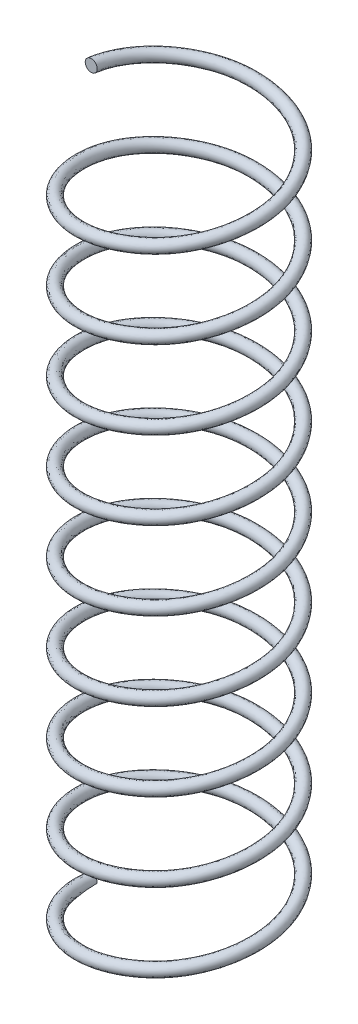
ISO-10303-21;
HEADER;
FILE_DESCRIPTION(('STEP AP214'),'2;1');
FILE_NAME('part.step','',(''),(''),'','','');
FILE_SCHEMA(('AUTOMOTIVE_DESIGN { 1 0 10303 214 1 1 1 1 }'));
ENDSEC;
DATA;
#1=APPLICATION_CONTEXT('core data for automotive mechanical design processes');
#2=APPLICATION_PROTOCOL_DEFINITION('international standard','automotive_design',2000,#1);
#3=PRODUCT_CONTEXT('',#1,'mechanical');
#4=PRODUCT('Part','Part','',(#3));
#5=PRODUCT_RELATED_PRODUCT_CATEGORY('part','',(#4));
#6=PRODUCT_DEFINITION_FORMATION('','',#4);
#7=PRODUCT_DEFINITION_CONTEXT('part definition',#1,'design');
#8=PRODUCT_DEFINITION('design','',#6,#7);
#9=PRODUCT_DEFINITION_SHAPE('','',#8);
#10=(LENGTH_UNIT() NAMED_UNIT(*) SI_UNIT(.MILLI.,.METRE.));
#11=(NAMED_UNIT(*) PLANE_ANGLE_UNIT() SI_UNIT($,.RADIAN.));
#12=(NAMED_UNIT(*) SI_UNIT($,.STERADIAN.) SOLID_ANGLE_UNIT());
#13=UNCERTAINTY_MEASURE_WITH_UNIT(LENGTH_MEASURE(1.E-05),#10,'distance_accuracy_value','');
#14=(GEOMETRIC_REPRESENTATION_CONTEXT(3) GLOBAL_UNCERTAINTY_ASSIGNED_CONTEXT((#13)) GLOBAL_UNIT_ASSIGNED_CONTEXT((#10,
#11,#12)) REPRESENTATION_CONTEXT('',''));
#15=CARTESIAN_POINT('',(0.,0.,0.));
#16=DIRECTION('',(0.,0.,1.));
#17=DIRECTION('',(1.,0.,0.));
#18=AXIS2_PLACEMENT_3D('',#15,#16,#17);
#19=CARTESIAN_POINT('',(-3.5179,0.,0.));
#20=DIRECTION('',(0.,0.,1.));
#21=DIRECTION('',(1.,0.,0.));
#22=AXIS2_PLACEMENT_3D('',#19,#20,#21);
#23=PLANE('',#22);
#24=CARTESIAN_POINT('',(-3.5179,0.,0.));
#25=DIRECTION('',(0.,0.,1.));
#26=DIRECTION('',(1.,0.,0.));
#27=AXIS2_PLACEMENT_3D('',#24,#25,#26);
#28=CIRCLE('',#27,0.2413);
#29=CARTESIAN_POINT('',(-3.2766,0.,0.));
#30=VERTEX_POINT('',#29);
#31=CARTESIAN_POINT('',(-3.7592,0.,0.));
#32=VERTEX_POINT('',#31);
#33=EDGE_CURVE('E59',#30,#32,#28,.T.);
#34=ORIENTED_EDGE('',*,*,#33,.F.);
#35=DIRECTION('',(-1.,0.,0.));
#36=VECTOR('',#35,1.);
#37=CARTESIAN_POINT('',(-3.5179,0.,0.));
#38=LINE('',#37,#36);
#39=EDGE_CURVE('E65',#30,#32,#38,.T.);
#40=ORIENTED_EDGE('',*,*,#39,.T.);
#41=EDGE_LOOP('',(#34,#40));
#42=FACE_BOUND('',#41,.T.);
#43=ADVANCED_FACE('F36',(#42),#23,.F.);
#44=CARTESIAN_POINT('',(-3.5179,28.261355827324,4.42176559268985E-13));
#45=DIRECTION('',(1.25693328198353E-13,0.,1.));
#46=DIRECTION('',(1.,0.,-1.25693328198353E-13));
#47=AXIS2_PLACEMENT_3D('',#44,#45,#46);
#48=PLANE('',#47);
#49=CARTESIAN_POINT('',(-3.5179,28.261355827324,4.42176559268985E-13));
#50=DIRECTION('',(1.25693328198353E-13,0.,1.));
#51=DIRECTION('',(1.,0.,-1.25693328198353E-13));
#52=AXIS2_PLACEMENT_3D('',#49,#50,#51);
#53=CIRCLE('',#52,0.2413);
#54=CARTESIAN_POINT('',(-3.2766,28.261355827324,4.11846759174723E-13));
#55=VERTEX_POINT('',#54);
#56=EDGE_CURVE('E48',#55,#55,#53,.T.);
#57=ORIENTED_EDGE('',*,*,#56,.T.);
#58=EDGE_LOOP('',(#57));
#59=FACE_BOUND('',#58,.T.);
#60=ADVANCED_FACE('F74',(#59),#48,.T.);
#61=CARTESIAN_POINT('',(-3.2766,0.,0.));
#62=CARTESIAN_POINT('',(-3.2766,0.26167922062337,1.89174589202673));
#63=CARTESIAN_POINT('',(-1.6383,0.52335844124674,2.83761883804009));
#64=CARTESIAN_POINT('',(0.,0.78503766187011,3.78349178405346));
#65=CARTESIAN_POINT('',(1.6383,1.04671688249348,2.83761883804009));
#66=CARTESIAN_POINT('',(3.2766,1.30839610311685,1.89174589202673));
#67=CARTESIAN_POINT('',(3.2766,1.57007532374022,0.));
#68=CARTESIAN_POINT('',(3.2766,1.83175454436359,-1.89174589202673));
#69=CARTESIAN_POINT('',(1.6383,2.09343376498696,-2.83761883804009));
#70=CARTESIAN_POINT('',(0.,2.35511298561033,-3.78349178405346));
#71=CARTESIAN_POINT('',(-1.6383,2.6167922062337,-2.83761883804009));
#72=CARTESIAN_POINT('',(-3.2766,2.87847142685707,-1.89174589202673));
#73=CARTESIAN_POINT('',(-3.2766,3.14015064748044,0.));
#74=CARTESIAN_POINT('',(-3.2766,3.40182986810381,1.89174589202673));
#75=CARTESIAN_POINT('',(-1.6383,3.66350908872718,2.83761883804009));
#76=CARTESIAN_POINT('',(0.,3.92518830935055,3.78349178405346));
#77=CARTESIAN_POINT('',(1.6383,4.18686752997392,2.83761883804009));
#78=CARTESIAN_POINT('',(3.2766,4.44854675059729,1.89174589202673));
#79=CARTESIAN_POINT('',(3.2766,4.71022597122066,0.));
#80=CARTESIAN_POINT('',(3.2766,4.97190519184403,-1.89174589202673));
#81=CARTESIAN_POINT('',(1.6383,5.2335844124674,-2.83761883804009));
#82=CARTESIAN_POINT('',(0.,5.49526363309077,-3.78349178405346));
#83=CARTESIAN_POINT('',(-1.6383,5.75694285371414,-2.83761883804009));
#84=CARTESIAN_POINT('',(-3.2766,6.01862207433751,-1.89174589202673));
#85=CARTESIAN_POINT('',(-3.2766,6.28030129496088,0.));
#86=CARTESIAN_POINT('',(-3.2766,6.54198051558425,1.89174589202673));
#87=CARTESIAN_POINT('',(-1.6383,6.80365973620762,2.83761883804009));
#88=CARTESIAN_POINT('',(0.,7.06533895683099,3.78349178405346));
#89=CARTESIAN_POINT('',(1.6383,7.32701817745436,2.83761883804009));
#90=CARTESIAN_POINT('',(3.2766,7.58869739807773,1.89174589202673));
#91=CARTESIAN_POINT('',(3.2766,7.8503766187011,0.));
#92=CARTESIAN_POINT('',(3.2766,8.11205583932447,-1.89174589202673));
#93=CARTESIAN_POINT('',(1.6383,8.37373505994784,-2.83761883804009));
#94=CARTESIAN_POINT('',(0.,8.63541428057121,-3.78349178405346));
#95=CARTESIAN_POINT('',(-1.6383,8.89709350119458,-2.83761883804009));
#96=CARTESIAN_POINT('',(-3.2766,9.15877272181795,-1.89174589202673));
#97=CARTESIAN_POINT('',(-3.2766,9.42045194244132,0.));
#98=CARTESIAN_POINT('',(-3.2766,9.68213116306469,1.89174589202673));
#99=CARTESIAN_POINT('',(-1.6383,9.94381038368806,2.83761883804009));
#100=CARTESIAN_POINT('',(0.,10.2054896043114,3.78349178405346));
#101=CARTESIAN_POINT('',(1.6383,10.4671688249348,2.83761883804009));
#102=CARTESIAN_POINT('',(3.2766,10.7288480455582,1.89174589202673));
#103=CARTESIAN_POINT('',(3.2766,10.9905272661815,0.));
#104=CARTESIAN_POINT('',(3.2766,11.2522064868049,-1.89174589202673));
#105=CARTESIAN_POINT('',(1.6383,11.5138857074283,-2.83761883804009));
#106=CARTESIAN_POINT('',(0.,11.7755649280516,-3.78349178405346));
#107=CARTESIAN_POINT('',(-1.6383,12.037244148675,-2.83761883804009));
#108=CARTESIAN_POINT('',(-3.2766,12.2989233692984,-1.89174589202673));
#109=CARTESIAN_POINT('',(-3.2766,12.5606025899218,0.));
#110=CARTESIAN_POINT('',(-3.2766,12.8222818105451,1.89174589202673));
#111=CARTESIAN_POINT('',(-1.6383,13.0839610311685,2.83761883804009));
#112=CARTESIAN_POINT('',(0.,13.3456402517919,3.78349178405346));
#113=CARTESIAN_POINT('',(1.6383,13.6073194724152,2.83761883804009));
#114=CARTESIAN_POINT('',(3.2766,13.8689986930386,1.89174589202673));
#115=CARTESIAN_POINT('',(3.2766,14.130677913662,0.));
#116=CARTESIAN_POINT('',(3.2766,14.3923571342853,-1.89174589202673));
#117=CARTESIAN_POINT('',(1.6383,14.6540363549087,-2.83761883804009));
#118=CARTESIAN_POINT('',(0.,14.9157155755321,-3.78349178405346));
#119=CARTESIAN_POINT('',(-1.6383,15.1773947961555,-2.83761883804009));
#120=CARTESIAN_POINT('',(-3.2766,15.4390740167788,-1.89174589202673));
#121=CARTESIAN_POINT('',(-3.2766,15.7007532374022,0.));
#122=CARTESIAN_POINT('',(-3.2766,15.9624324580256,1.89174589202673));
#123=CARTESIAN_POINT('',(-1.6383,16.2241116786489,2.83761883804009));
#124=CARTESIAN_POINT('',(0.,16.4857908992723,3.78349178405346));
#125=CARTESIAN_POINT('',(1.6383,16.7474701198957,2.83761883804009));
#126=CARTESIAN_POINT('',(3.2766,17.009149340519,1.89174589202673));
#127=CARTESIAN_POINT('',(3.2766,17.2708285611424,0.));
#128=CARTESIAN_POINT('',(3.2766,17.5325077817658,-1.89174589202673));
#129=CARTESIAN_POINT('',(1.6383,17.7941870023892,-2.83761883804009));
#130=CARTESIAN_POINT('',(0.,18.0558662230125,-3.78349178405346));
#131=CARTESIAN_POINT('',(-1.6383,18.3175454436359,-2.83761883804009));
#132=CARTESIAN_POINT('',(-3.2766,18.5792246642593,-1.89174589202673));
#133=CARTESIAN_POINT('',(-3.2766,18.8409038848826,0.));
#134=CARTESIAN_POINT('',(-3.2766,19.102583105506,1.89174589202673));
#135=CARTESIAN_POINT('',(-1.6383,19.3642623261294,2.83761883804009));
#136=CARTESIAN_POINT('',(0.,19.6259415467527,3.78349178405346));
#137=CARTESIAN_POINT('',(1.6383,19.8876207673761,2.83761883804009));
#138=CARTESIAN_POINT('',(3.2766,20.1492999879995,1.89174589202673));
#139=CARTESIAN_POINT('',(3.2766,20.4109792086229,0.));
#140=CARTESIAN_POINT('',(3.2766,20.6726584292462,-1.89174589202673));
#141=CARTESIAN_POINT('',(1.6383,20.9343376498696,-2.83761883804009));
#142=CARTESIAN_POINT('',(0.,21.196016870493,-3.78349178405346));
#143=CARTESIAN_POINT('',(-1.6383,21.4576960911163,-2.83761883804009));
#144=CARTESIAN_POINT('',(-3.2766,21.7193753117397,-1.89174589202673));
#145=CARTESIAN_POINT('',(-3.2766,21.9810545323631,0.));
#146=CARTESIAN_POINT('',(-3.2766,22.2427337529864,1.89174589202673));
#147=CARTESIAN_POINT('',(-1.6383,22.5044129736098,2.83761883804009));
#148=CARTESIAN_POINT('',(0.,22.7660921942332,3.78349178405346));
#149=CARTESIAN_POINT('',(1.6383,23.0277714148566,2.83761883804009));
#150=CARTESIAN_POINT('',(3.2766,23.2894506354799,1.89174589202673));
#151=CARTESIAN_POINT('',(3.2766,23.5511298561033,0.));
#152=CARTESIAN_POINT('',(3.2766,23.8128090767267,-1.89174589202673));
#153=CARTESIAN_POINT('',(1.6383,24.07448829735,-2.83761883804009));
#154=CARTESIAN_POINT('',(0.,24.3361675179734,-3.78349178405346));
#155=CARTESIAN_POINT('',(-1.6383,24.5978467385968,-2.83761883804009));
#156=CARTESIAN_POINT('',(-3.2766,24.8595259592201,-1.89174589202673));
#157=CARTESIAN_POINT('',(-3.2766,25.1212051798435,0.));
#158=CARTESIAN_POINT('',(-3.2766,25.3828844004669,1.89174589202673));
#159=CARTESIAN_POINT('',(-1.6383,25.6445636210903,2.83761883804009));
#160=CARTESIAN_POINT('',(0.,25.9062428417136,3.78349178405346));
#161=CARTESIAN_POINT('',(1.6383,26.167922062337,2.83761883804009));
#162=CARTESIAN_POINT('',(3.2766,26.4296012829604,1.89174589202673));
#163=CARTESIAN_POINT('',(3.2766,26.6912805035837,0.));
#164=CARTESIAN_POINT('',(3.2766,26.9529597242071,-1.89174589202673));
#165=CARTESIAN_POINT('',(1.6383,27.2146389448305,-2.83761883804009));
#166=CARTESIAN_POINT('',(0.,27.4763181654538,-3.78349178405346));
#167=CARTESIAN_POINT('',(-1.6383,27.7379973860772,-2.83761883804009));
#168=CARTESIAN_POINT('',(-3.2766,27.9996766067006,-1.89174589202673));
#169=CARTESIAN_POINT('',(-3.2766,28.261355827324,0.));
#170=CARTESIAN_POINT('',(-3.2766,28.5230350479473,1.89174589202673));
#171=CARTESIAN_POINT('',(-1.6383,28.7847142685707,2.83761883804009));
#172=CARTESIAN_POINT('',(0.,29.0463934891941,3.78349178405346));
#173=CARTESIAN_POINT('',(1.6383,29.3080727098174,2.83761883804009));
#174=CARTESIAN_POINT('',(3.2766,29.5697519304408,1.89174589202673));
#175=CARTESIAN_POINT('',(3.2766,29.8314311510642,0.));
#176=CARTESIAN_POINT('',(3.2766,30.0931103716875,-1.89174589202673));
#177=CARTESIAN_POINT('',(1.6383,30.3547895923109,-2.83761883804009));
#178=CARTESIAN_POINT('',(0.,30.6164688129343,-3.78349178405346));
#179=CARTESIAN_POINT('',(-1.6383,30.8781480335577,-2.83761883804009));
#180=CARTESIAN_POINT('',(-3.2766,31.139827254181,-1.89174589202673));
#181=CARTESIAN_POINT('',(-3.2766,31.4015064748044,0.));
#182=CARTESIAN_POINT('',(-3.2766,0.4826,0.));
#183=CARTESIAN_POINT('',(-3.2766,0.74427922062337,1.89174589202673));
#184=CARTESIAN_POINT('',(-1.6383,1.00595844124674,2.83761883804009));
#185=CARTESIAN_POINT('',(0.,1.26763766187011,3.78349178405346));
#186=CARTESIAN_POINT('',(1.6383,1.52931688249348,2.83761883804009));
#187=CARTESIAN_POINT('',(3.2766,1.79099610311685,1.89174589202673));
#188=CARTESIAN_POINT('',(3.2766,2.05267532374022,0.));
#189=CARTESIAN_POINT('',(3.2766,2.31435454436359,-1.89174589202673));
#190=CARTESIAN_POINT('',(1.6383,2.57603376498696,-2.83761883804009));
#191=CARTESIAN_POINT('',(0.,2.83771298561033,-3.78349178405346));
#192=CARTESIAN_POINT('',(-1.6383,3.0993922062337,-2.83761883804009));
#193=CARTESIAN_POINT('',(-3.2766,3.36107142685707,-1.89174589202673));
#194=CARTESIAN_POINT('',(-3.2766,3.62275064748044,0.));
#195=CARTESIAN_POINT('',(-3.2766,3.88442986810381,1.89174589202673));
#196=CARTESIAN_POINT('',(-1.6383,4.14610908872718,2.83761883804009));
#197=CARTESIAN_POINT('',(0.,4.40778830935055,3.78349178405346));
#198=CARTESIAN_POINT('',(1.6383,4.66946752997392,2.83761883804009));
#199=CARTESIAN_POINT('',(3.2766,4.93114675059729,1.89174589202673));
#200=CARTESIAN_POINT('',(3.2766,5.19282597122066,0.));
#201=CARTESIAN_POINT('',(3.2766,5.45450519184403,-1.89174589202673));
#202=CARTESIAN_POINT('',(1.6383,5.7161844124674,-2.83761883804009));
#203=CARTESIAN_POINT('',(0.,5.97786363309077,-3.78349178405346));
#204=CARTESIAN_POINT('',(-1.6383,6.23954285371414,-2.83761883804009));
#205=CARTESIAN_POINT('',(-3.2766,6.50122207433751,-1.89174589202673));
#206=CARTESIAN_POINT('',(-3.2766,6.76290129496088,0.));
#207=CARTESIAN_POINT('',(-3.2766,7.02458051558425,1.89174589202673));
#208=CARTESIAN_POINT('',(-1.6383,7.28625973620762,2.83761883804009));
#209=CARTESIAN_POINT('',(0.,7.54793895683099,3.78349178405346));
#210=CARTESIAN_POINT('',(1.6383,7.80961817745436,2.83761883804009));
#211=CARTESIAN_POINT('',(3.2766,8.07129739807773,1.89174589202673));
#212=CARTESIAN_POINT('',(3.2766,8.3329766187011,0.));
#213=CARTESIAN_POINT('',(3.2766,8.59465583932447,-1.89174589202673));
#214=CARTESIAN_POINT('',(1.6383,8.85633505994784,-2.83761883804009));
#215=CARTESIAN_POINT('',(0.,9.11801428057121,-3.78349178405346));
#216=CARTESIAN_POINT('',(-1.6383,9.37969350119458,-2.83761883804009));
#217=CARTESIAN_POINT('',(-3.2766,9.64137272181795,-1.89174589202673));
#218=CARTESIAN_POINT('',(-3.2766,9.90305194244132,0.));
#219=CARTESIAN_POINT('',(-3.2766,10.1647311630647,1.89174589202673));
#220=CARTESIAN_POINT('',(-1.6383,10.4264103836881,2.83761883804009));
#221=CARTESIAN_POINT('',(0.,10.6880896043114,3.78349178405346));
#222=CARTESIAN_POINT('',(1.6383,10.9497688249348,2.83761883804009));
#223=CARTESIAN_POINT('',(3.2766,11.2114480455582,1.89174589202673));
#224=CARTESIAN_POINT('',(3.2766,11.4731272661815,0.));
#225=CARTESIAN_POINT('',(3.2766,11.7348064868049,-1.89174589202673));
#226=CARTESIAN_POINT('',(1.6383,11.9964857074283,-2.83761883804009));
#227=CARTESIAN_POINT('',(0.,12.2581649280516,-3.78349178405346));
#228=CARTESIAN_POINT('',(-1.6383,12.519844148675,-2.83761883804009));
#229=CARTESIAN_POINT('',(-3.2766,12.7815233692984,-1.89174589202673));
#230=CARTESIAN_POINT('',(-3.2766,13.0432025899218,0.));
#231=CARTESIAN_POINT('',(-3.2766,13.3048818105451,1.89174589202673));
#232=CARTESIAN_POINT('',(-1.6383,13.5665610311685,2.83761883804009));
#233=CARTESIAN_POINT('',(0.,13.8282402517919,3.78349178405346));
#234=CARTESIAN_POINT('',(1.6383,14.0899194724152,2.83761883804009));
#235=CARTESIAN_POINT('',(3.2766,14.3515986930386,1.89174589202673));
#236=CARTESIAN_POINT('',(3.2766,14.613277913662,0.));
#237=CARTESIAN_POINT('',(3.2766,14.8749571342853,-1.89174589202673));
#238=CARTESIAN_POINT('',(1.6383,15.1366363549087,-2.83761883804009));
#239=CARTESIAN_POINT('',(0.,15.3983155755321,-3.78349178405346));
#240=CARTESIAN_POINT('',(-1.6383,15.6599947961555,-2.83761883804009));
#241=CARTESIAN_POINT('',(-3.2766,15.9216740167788,-1.89174589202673));
#242=CARTESIAN_POINT('',(-3.2766,16.1833532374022,0.));
#243=CARTESIAN_POINT('',(-3.2766,16.4450324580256,1.89174589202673));
#244=CARTESIAN_POINT('',(-1.6383,16.7067116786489,2.83761883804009));
#245=CARTESIAN_POINT('',(0.,16.9683908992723,3.78349178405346));
#246=CARTESIAN_POINT('',(1.6383,17.2300701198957,2.83761883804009));
#247=CARTESIAN_POINT('',(3.2766,17.491749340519,1.89174589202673));
#248=CARTESIAN_POINT('',(3.2766,17.7534285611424,0.));
#249=CARTESIAN_POINT('',(3.2766,18.0151077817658,-1.89174589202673));
#250=CARTESIAN_POINT('',(1.6383,18.2767870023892,-2.83761883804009));
#251=CARTESIAN_POINT('',(0.,18.5384662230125,-3.78349178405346));
#252=CARTESIAN_POINT('',(-1.6383,18.8001454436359,-2.83761883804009));
#253=CARTESIAN_POINT('',(-3.2766,19.0618246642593,-1.89174589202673));
#254=CARTESIAN_POINT('',(-3.2766,19.3235038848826,0.));
#255=CARTESIAN_POINT('',(-3.2766,19.585183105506,1.89174589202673));
#256=CARTESIAN_POINT('',(-1.6383,19.8468623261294,2.83761883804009));
#257=CARTESIAN_POINT('',(0.,20.1085415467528,3.78349178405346));
#258=CARTESIAN_POINT('',(1.6383,20.3702207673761,2.83761883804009));
#259=CARTESIAN_POINT('',(3.2766,20.6318999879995,1.89174589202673));
#260=CARTESIAN_POINT('',(3.2766,20.8935792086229,0.));
#261=CARTESIAN_POINT('',(3.2766,21.1552584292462,-1.89174589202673));
#262=CARTESIAN_POINT('',(1.6383,21.4169376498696,-2.83761883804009));
#263=CARTESIAN_POINT('',(0.,21.678616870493,-3.78349178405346));
#264=CARTESIAN_POINT('',(-1.6383,21.9402960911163,-2.83761883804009));
#265=CARTESIAN_POINT('',(-3.2766,22.2019753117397,-1.89174589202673));
#266=CARTESIAN_POINT('',(-3.2766,22.4636545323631,0.));
#267=CARTESIAN_POINT('',(-3.2766,22.7253337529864,1.89174589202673));
#268=CARTESIAN_POINT('',(-1.6383,22.9870129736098,2.83761883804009));
#269=CARTESIAN_POINT('',(0.,23.2486921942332,3.78349178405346));
#270=CARTESIAN_POINT('',(1.6383,23.5103714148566,2.83761883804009));
#271=CARTESIAN_POINT('',(3.2766,23.7720506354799,1.89174589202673));
#272=CARTESIAN_POINT('',(3.2766,24.0337298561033,0.));
#273=CARTESIAN_POINT('',(3.2766,24.2954090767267,-1.89174589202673));
#274=CARTESIAN_POINT('',(1.6383,24.55708829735,-2.83761883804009));
#275=CARTESIAN_POINT('',(0.,24.8187675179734,-3.78349178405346));
#276=CARTESIAN_POINT('',(-1.6383,25.0804467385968,-2.83761883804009));
#277=CARTESIAN_POINT('',(-3.2766,25.3421259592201,-1.89174589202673));
#278=CARTESIAN_POINT('',(-3.2766,25.6038051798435,0.));
#279=CARTESIAN_POINT('',(-3.2766,25.8654844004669,1.89174589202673));
#280=CARTESIAN_POINT('',(-1.6383,26.1271636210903,2.83761883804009));
#281=CARTESIAN_POINT('',(0.,26.3888428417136,3.78349178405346));
#282=CARTESIAN_POINT('',(1.6383,26.650522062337,2.83761883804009));
#283=CARTESIAN_POINT('',(3.2766,26.9122012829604,1.89174589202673));
#284=CARTESIAN_POINT('',(3.2766,27.1738805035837,0.));
#285=CARTESIAN_POINT('',(3.2766,27.4355597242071,-1.89174589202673));
#286=CARTESIAN_POINT('',(1.6383,27.6972389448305,-2.83761883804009));
#287=CARTESIAN_POINT('',(0.,27.9589181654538,-3.78349178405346));
#288=CARTESIAN_POINT('',(-1.6383,28.2205973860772,-2.83761883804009));
#289=CARTESIAN_POINT('',(-3.2766,28.4822766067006,-1.89174589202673));
#290=CARTESIAN_POINT('',(-3.2766,28.743955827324,0.));
#291=CARTESIAN_POINT('',(-3.2766,29.0056350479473,1.89174589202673));
#292=CARTESIAN_POINT('',(-1.6383,29.2673142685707,2.83761883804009));
#293=CARTESIAN_POINT('',(0.,29.5289934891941,3.78349178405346));
#294=CARTESIAN_POINT('',(1.6383,29.7906727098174,2.83761883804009));
#295=CARTESIAN_POINT('',(3.2766,30.0523519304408,1.89174589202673));
#296=CARTESIAN_POINT('',(3.2766,30.3140311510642,0.));
#297=CARTESIAN_POINT('',(3.2766,30.5757103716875,-1.89174589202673));
#298=CARTESIAN_POINT('',(1.6383,30.8373895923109,-2.83761883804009));
#299=CARTESIAN_POINT('',(0.,31.0990688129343,-3.78349178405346));
#300=CARTESIAN_POINT('',(-1.6383,31.3607480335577,-2.83761883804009));
#301=CARTESIAN_POINT('',(-3.2766,31.622427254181,-1.89174589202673));
#302=CARTESIAN_POINT('',(-3.2766,31.8841064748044,0.));
#303=CARTESIAN_POINT('',(-3.7592,0.4826,0.));
#304=CARTESIAN_POINT('',(-3.7592,0.74427922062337,2.17037513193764));
#305=CARTESIAN_POINT('',(-1.8796,1.00595844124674,3.25556269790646));
#306=CARTESIAN_POINT('',(0.,1.26763766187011,4.34075026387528));
#307=CARTESIAN_POINT('',(1.8796,1.52931688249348,3.25556269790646));
#308=CARTESIAN_POINT('',(3.7592,1.79099610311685,2.17037513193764));
#309=CARTESIAN_POINT('',(3.7592,2.05267532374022,0.));
#310=CARTESIAN_POINT('',(3.7592,2.31435454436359,-2.17037513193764));
#311=CARTESIAN_POINT('',(1.8796,2.57603376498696,-3.25556269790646));
#312=CARTESIAN_POINT('',(0.,2.83771298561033,-4.34075026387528));
#313=CARTESIAN_POINT('',(-1.8796,3.0993922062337,-3.25556269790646));
#314=CARTESIAN_POINT('',(-3.7592,3.36107142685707,-2.17037513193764));
#315=CARTESIAN_POINT('',(-3.7592,3.62275064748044,0.));
#316=CARTESIAN_POINT('',(-3.7592,3.88442986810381,2.17037513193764));
#317=CARTESIAN_POINT('',(-1.8796,4.14610908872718,3.25556269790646));
#318=CARTESIAN_POINT('',(0.,4.40778830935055,4.34075026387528));
#319=CARTESIAN_POINT('',(1.8796,4.66946752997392,3.25556269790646));
#320=CARTESIAN_POINT('',(3.7592,4.93114675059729,2.17037513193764));
#321=CARTESIAN_POINT('',(3.7592,5.19282597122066,0.));
#322=CARTESIAN_POINT('',(3.7592,5.45450519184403,-2.17037513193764));
#323=CARTESIAN_POINT('',(1.8796,5.7161844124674,-3.25556269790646));
#324=CARTESIAN_POINT('',(0.,5.97786363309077,-4.34075026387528));
#325=CARTESIAN_POINT('',(-1.8796,6.23954285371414,-3.25556269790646));
#326=CARTESIAN_POINT('',(-3.7592,6.50122207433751,-2.17037513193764));
#327=CARTESIAN_POINT('',(-3.7592,6.76290129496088,0.));
#328=CARTESIAN_POINT('',(-3.7592,7.02458051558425,2.17037513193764));
#329=CARTESIAN_POINT('',(-1.8796,7.28625973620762,3.25556269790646));
#330=CARTESIAN_POINT('',(0.,7.54793895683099,4.34075026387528));
#331=CARTESIAN_POINT('',(1.8796,7.80961817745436,3.25556269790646));
#332=CARTESIAN_POINT('',(3.7592,8.07129739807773,2.17037513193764));
#333=CARTESIAN_POINT('',(3.7592,8.3329766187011,0.));
#334=CARTESIAN_POINT('',(3.7592,8.59465583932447,-2.17037513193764));
#335=CARTESIAN_POINT('',(1.8796,8.85633505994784,-3.25556269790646));
#336=CARTESIAN_POINT('',(0.,9.11801428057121,-4.34075026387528));
#337=CARTESIAN_POINT('',(-1.8796,9.37969350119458,-3.25556269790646));
#338=CARTESIAN_POINT('',(-3.7592,9.64137272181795,-2.17037513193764));
#339=CARTESIAN_POINT('',(-3.7592,9.90305194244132,0.));
#340=CARTESIAN_POINT('',(-3.7592,10.1647311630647,2.17037513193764));
#341=CARTESIAN_POINT('',(-1.8796,10.4264103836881,3.25556269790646));
#342=CARTESIAN_POINT('',(0.,10.6880896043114,4.34075026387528));
#343=CARTESIAN_POINT('',(1.8796,10.9497688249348,3.25556269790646));
#344=CARTESIAN_POINT('',(3.7592,11.2114480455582,2.17037513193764));
#345=CARTESIAN_POINT('',(3.7592,11.4731272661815,0.));
#346=CARTESIAN_POINT('',(3.7592,11.7348064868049,-2.17037513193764));
#347=CARTESIAN_POINT('',(1.8796,11.9964857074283,-3.25556269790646));
#348=CARTESIAN_POINT('',(0.,12.2581649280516,-4.34075026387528));
#349=CARTESIAN_POINT('',(-1.8796,12.519844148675,-3.25556269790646));
#350=CARTESIAN_POINT('',(-3.7592,12.7815233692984,-2.17037513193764));
#351=CARTESIAN_POINT('',(-3.7592,13.0432025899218,0.));
#352=CARTESIAN_POINT('',(-3.7592,13.3048818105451,2.17037513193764));
#353=CARTESIAN_POINT('',(-1.8796,13.5665610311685,3.25556269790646));
#354=CARTESIAN_POINT('',(0.,13.8282402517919,4.34075026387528));
#355=CARTESIAN_POINT('',(1.8796,14.0899194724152,3.25556269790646));
#356=CARTESIAN_POINT('',(3.7592,14.3515986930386,2.17037513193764));
#357=CARTESIAN_POINT('',(3.7592,14.613277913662,0.));
#358=CARTESIAN_POINT('',(3.7592,14.8749571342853,-2.17037513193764));
#359=CARTESIAN_POINT('',(1.8796,15.1366363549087,-3.25556269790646));
#360=CARTESIAN_POINT('',(0.,15.3983155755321,-4.34075026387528));
#361=CARTESIAN_POINT('',(-1.8796,15.6599947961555,-3.25556269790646));
#362=CARTESIAN_POINT('',(-3.7592,15.9216740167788,-2.17037513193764));
#363=CARTESIAN_POINT('',(-3.7592,16.1833532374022,0.));
#364=CARTESIAN_POINT('',(-3.7592,16.4450324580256,2.17037513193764));
#365=CARTESIAN_POINT('',(-1.8796,16.7067116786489,3.25556269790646));
#366=CARTESIAN_POINT('',(0.,16.9683908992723,4.34075026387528));
#367=CARTESIAN_POINT('',(1.8796,17.2300701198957,3.25556269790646));
#368=CARTESIAN_POINT('',(3.7592,17.491749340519,2.17037513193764));
#369=CARTESIAN_POINT('',(3.7592,17.7534285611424,0.));
#370=CARTESIAN_POINT('',(3.7592,18.0151077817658,-2.17037513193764));
#371=CARTESIAN_POINT('',(1.8796,18.2767870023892,-3.25556269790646));
#372=CARTESIAN_POINT('',(0.,18.5384662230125,-4.34075026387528));
#373=CARTESIAN_POINT('',(-1.8796,18.8001454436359,-3.25556269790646));
#374=CARTESIAN_POINT('',(-3.7592,19.0618246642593,-2.17037513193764));
#375=CARTESIAN_POINT('',(-3.7592,19.3235038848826,0.));
#376=CARTESIAN_POINT('',(-3.7592,19.585183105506,2.17037513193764));
#377=CARTESIAN_POINT('',(-1.8796,19.8468623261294,3.25556269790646));
#378=CARTESIAN_POINT('',(0.,20.1085415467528,4.34075026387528));
#379=CARTESIAN_POINT('',(1.8796,20.3702207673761,3.25556269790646));
#380=CARTESIAN_POINT('',(3.7592,20.6318999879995,2.17037513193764));
#381=CARTESIAN_POINT('',(3.7592,20.8935792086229,0.));
#382=CARTESIAN_POINT('',(3.7592,21.1552584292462,-2.17037513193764));
#383=CARTESIAN_POINT('',(1.8796,21.4169376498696,-3.25556269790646));
#384=CARTESIAN_POINT('',(0.,21.678616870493,-4.34075026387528));
#385=CARTESIAN_POINT('',(-1.8796,21.9402960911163,-3.25556269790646));
#386=CARTESIAN_POINT('',(-3.7592,22.2019753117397,-2.17037513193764));
#387=CARTESIAN_POINT('',(-3.7592,22.4636545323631,0.));
#388=CARTESIAN_POINT('',(-3.7592,22.7253337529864,2.17037513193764));
#389=CARTESIAN_POINT('',(-1.8796,22.9870129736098,3.25556269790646));
#390=CARTESIAN_POINT('',(0.,23.2486921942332,4.34075026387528));
#391=CARTESIAN_POINT('',(1.8796,23.5103714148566,3.25556269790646));
#392=CARTESIAN_POINT('',(3.7592,23.7720506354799,2.17037513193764));
#393=CARTESIAN_POINT('',(3.7592,24.0337298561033,0.));
#394=CARTESIAN_POINT('',(3.7592,24.2954090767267,-2.17037513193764));
#395=CARTESIAN_POINT('',(1.8796,24.55708829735,-3.25556269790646));
#396=CARTESIAN_POINT('',(0.,24.8187675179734,-4.34075026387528));
#397=CARTESIAN_POINT('',(-1.8796,25.0804467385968,-3.25556269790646));
#398=CARTESIAN_POINT('',(-3.7592,25.3421259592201,-2.17037513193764));
#399=CARTESIAN_POINT('',(-3.7592,25.6038051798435,0.));
#400=CARTESIAN_POINT('',(-3.7592,25.8654844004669,2.17037513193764));
#401=CARTESIAN_POINT('',(-1.8796,26.1271636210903,3.25556269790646));
#402=CARTESIAN_POINT('',(0.,26.3888428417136,4.34075026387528));
#403=CARTESIAN_POINT('',(1.8796,26.650522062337,3.25556269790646));
#404=CARTESIAN_POINT('',(3.7592,26.9122012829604,2.17037513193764));
#405=CARTESIAN_POINT('',(3.7592,27.1738805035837,0.));
#406=CARTESIAN_POINT('',(3.7592,27.4355597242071,-2.17037513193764));
#407=CARTESIAN_POINT('',(1.8796,27.6972389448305,-3.25556269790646));
#408=CARTESIAN_POINT('',(0.,27.9589181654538,-4.34075026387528));
#409=CARTESIAN_POINT('',(-1.8796,28.2205973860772,-3.25556269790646));
#410=CARTESIAN_POINT('',(-3.7592,28.4822766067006,-2.17037513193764));
#411=CARTESIAN_POINT('',(-3.7592,28.743955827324,0.));
#412=CARTESIAN_POINT('',(-3.7592,29.0056350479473,2.17037513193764));
#413=CARTESIAN_POINT('',(-1.8796,29.2673142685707,3.25556269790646));
#414=CARTESIAN_POINT('',(0.,29.5289934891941,4.34075026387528));
#415=CARTESIAN_POINT('',(1.8796,29.7906727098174,3.25556269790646));
#416=CARTESIAN_POINT('',(3.7592,30.0523519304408,2.17037513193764));
#417=CARTESIAN_POINT('',(3.7592,30.3140311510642,0.));
#418=CARTESIAN_POINT('',(3.7592,30.5757103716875,-2.17037513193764));
#419=CARTESIAN_POINT('',(1.8796,30.8373895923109,-3.25556269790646));
#420=CARTESIAN_POINT('',(0.,31.0990688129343,-4.34075026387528));
#421=CARTESIAN_POINT('',(-1.8796,31.3607480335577,-3.25556269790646));
#422=CARTESIAN_POINT('',(-3.7592,31.622427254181,-2.17037513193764));
#423=CARTESIAN_POINT('',(-3.7592,31.8841064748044,0.));
#424=CARTESIAN_POINT('',(-3.7592,0.,0.));
#425=CARTESIAN_POINT('',(-3.7592,0.26167922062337,2.17037513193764));
#426=CARTESIAN_POINT('',(-1.8796,0.52335844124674,3.25556269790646));
#427=CARTESIAN_POINT('',(0.,0.78503766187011,4.34075026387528));
#428=CARTESIAN_POINT('',(1.8796,1.04671688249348,3.25556269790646));
#429=CARTESIAN_POINT('',(3.7592,1.30839610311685,2.17037513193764));
#430=CARTESIAN_POINT('',(3.7592,1.57007532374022,0.));
#431=CARTESIAN_POINT('',(3.7592,1.83175454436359,-2.17037513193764));
#432=CARTESIAN_POINT('',(1.8796,2.09343376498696,-3.25556269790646));
#433=CARTESIAN_POINT('',(0.,2.35511298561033,-4.34075026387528));
#434=CARTESIAN_POINT('',(-1.8796,2.6167922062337,-3.25556269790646));
#435=CARTESIAN_POINT('',(-3.7592,2.87847142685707,-2.17037513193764));
#436=CARTESIAN_POINT('',(-3.7592,3.14015064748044,0.));
#437=CARTESIAN_POINT('',(-3.7592,3.40182986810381,2.17037513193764));
#438=CARTESIAN_POINT('',(-1.8796,3.66350908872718,3.25556269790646));
#439=CARTESIAN_POINT('',(0.,3.92518830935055,4.34075026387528));
#440=CARTESIAN_POINT('',(1.8796,4.18686752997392,3.25556269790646));
#441=CARTESIAN_POINT('',(3.7592,4.44854675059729,2.17037513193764));
#442=CARTESIAN_POINT('',(3.7592,4.71022597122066,0.));
#443=CARTESIAN_POINT('',(3.7592,4.97190519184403,-2.17037513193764));
#444=CARTESIAN_POINT('',(1.8796,5.2335844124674,-3.25556269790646));
#445=CARTESIAN_POINT('',(0.,5.49526363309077,-4.34075026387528));
#446=CARTESIAN_POINT('',(-1.8796,5.75694285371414,-3.25556269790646));
#447=CARTESIAN_POINT('',(-3.7592,6.01862207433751,-2.17037513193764));
#448=CARTESIAN_POINT('',(-3.7592,6.28030129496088,0.));
#449=CARTESIAN_POINT('',(-3.7592,6.54198051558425,2.17037513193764));
#450=CARTESIAN_POINT('',(-1.8796,6.80365973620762,3.25556269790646));
#451=CARTESIAN_POINT('',(0.,7.06533895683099,4.34075026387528));
#452=CARTESIAN_POINT('',(1.8796,7.32701817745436,3.25556269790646));
#453=CARTESIAN_POINT('',(3.7592,7.58869739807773,2.17037513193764));
#454=CARTESIAN_POINT('',(3.7592,7.8503766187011,0.));
#455=CARTESIAN_POINT('',(3.7592,8.11205583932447,-2.17037513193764));
#456=CARTESIAN_POINT('',(1.8796,8.37373505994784,-3.25556269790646));
#457=CARTESIAN_POINT('',(0.,8.63541428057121,-4.34075026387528));
#458=CARTESIAN_POINT('',(-1.8796,8.89709350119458,-3.25556269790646));
#459=CARTESIAN_POINT('',(-3.7592,9.15877272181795,-2.17037513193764));
#460=CARTESIAN_POINT('',(-3.7592,9.42045194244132,0.));
#461=CARTESIAN_POINT('',(-3.7592,9.68213116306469,2.17037513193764));
#462=CARTESIAN_POINT('',(-1.8796,9.94381038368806,3.25556269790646));
#463=CARTESIAN_POINT('',(0.,10.2054896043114,4.34075026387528));
#464=CARTESIAN_POINT('',(1.8796,10.4671688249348,3.25556269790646));
#465=CARTESIAN_POINT('',(3.7592,10.7288480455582,2.17037513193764));
#466=CARTESIAN_POINT('',(3.7592,10.9905272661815,0.));
#467=CARTESIAN_POINT('',(3.7592,11.2522064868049,-2.17037513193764));
#468=CARTESIAN_POINT('',(1.8796,11.5138857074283,-3.25556269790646));
#469=CARTESIAN_POINT('',(0.,11.7755649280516,-4.34075026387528));
#470=CARTESIAN_POINT('',(-1.8796,12.037244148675,-3.25556269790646));
#471=CARTESIAN_POINT('',(-3.7592,12.2989233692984,-2.17037513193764));
#472=CARTESIAN_POINT('',(-3.7592,12.5606025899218,0.));
#473=CARTESIAN_POINT('',(-3.7592,12.8222818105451,2.17037513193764));
#474=CARTESIAN_POINT('',(-1.8796,13.0839610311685,3.25556269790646));
#475=CARTESIAN_POINT('',(0.,13.3456402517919,4.34075026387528));
#476=CARTESIAN_POINT('',(1.8796,13.6073194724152,3.25556269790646));
#477=CARTESIAN_POINT('',(3.7592,13.8689986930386,2.17037513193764));
#478=CARTESIAN_POINT('',(3.7592,14.130677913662,0.));
#479=CARTESIAN_POINT('',(3.7592,14.3923571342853,-2.17037513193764));
#480=CARTESIAN_POINT('',(1.8796,14.6540363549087,-3.25556269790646));
#481=CARTESIAN_POINT('',(0.,14.9157155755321,-4.34075026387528));
#482=CARTESIAN_POINT('',(-1.8796,15.1773947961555,-3.25556269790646));
#483=CARTESIAN_POINT('',(-3.7592,15.4390740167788,-2.17037513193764));
#484=CARTESIAN_POINT('',(-3.7592,15.7007532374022,0.));
#485=CARTESIAN_POINT('',(-3.7592,15.9624324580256,2.17037513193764));
#486=CARTESIAN_POINT('',(-1.8796,16.2241116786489,3.25556269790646));
#487=CARTESIAN_POINT('',(0.,16.4857908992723,4.34075026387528));
#488=CARTESIAN_POINT('',(1.8796,16.7474701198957,3.25556269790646));
#489=CARTESIAN_POINT('',(3.7592,17.009149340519,2.17037513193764));
#490=CARTESIAN_POINT('',(3.7592,17.2708285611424,0.));
#491=CARTESIAN_POINT('',(3.7592,17.5325077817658,-2.17037513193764));
#492=CARTESIAN_POINT('',(1.8796,17.7941870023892,-3.25556269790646));
#493=CARTESIAN_POINT('',(0.,18.0558662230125,-4.34075026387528));
#494=CARTESIAN_POINT('',(-1.8796,18.3175454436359,-3.25556269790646));
#495=CARTESIAN_POINT('',(-3.7592,18.5792246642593,-2.17037513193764));
#496=CARTESIAN_POINT('',(-3.7592,18.8409038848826,0.));
#497=CARTESIAN_POINT('',(-3.7592,19.102583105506,2.17037513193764));
#498=CARTESIAN_POINT('',(-1.8796,19.3642623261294,3.25556269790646));
#499=CARTESIAN_POINT('',(0.,19.6259415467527,4.34075026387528));
#500=CARTESIAN_POINT('',(1.8796,19.8876207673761,3.25556269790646));
#501=CARTESIAN_POINT('',(3.7592,20.1492999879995,2.17037513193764));
#502=CARTESIAN_POINT('',(3.7592,20.4109792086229,0.));
#503=CARTESIAN_POINT('',(3.7592,20.6726584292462,-2.17037513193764));
#504=CARTESIAN_POINT('',(1.8796,20.9343376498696,-3.25556269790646));
#505=CARTESIAN_POINT('',(0.,21.196016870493,-4.34075026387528));
#506=CARTESIAN_POINT('',(-1.8796,21.4576960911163,-3.25556269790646));
#507=CARTESIAN_POINT('',(-3.7592,21.7193753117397,-2.17037513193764));
#508=CARTESIAN_POINT('',(-3.7592,21.9810545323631,0.));
#509=CARTESIAN_POINT('',(-3.7592,22.2427337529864,2.17037513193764));
#510=CARTESIAN_POINT('',(-1.8796,22.5044129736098,3.25556269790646));
#511=CARTESIAN_POINT('',(0.,22.7660921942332,4.34075026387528));
#512=CARTESIAN_POINT('',(1.8796,23.0277714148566,3.25556269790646));
#513=CARTESIAN_POINT('',(3.7592,23.2894506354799,2.17037513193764));
#514=CARTESIAN_POINT('',(3.7592,23.5511298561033,0.));
#515=CARTESIAN_POINT('',(3.7592,23.8128090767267,-2.17037513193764));
#516=CARTESIAN_POINT('',(1.8796,24.07448829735,-3.25556269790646));
#517=CARTESIAN_POINT('',(0.,24.3361675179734,-4.34075026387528));
#518=CARTESIAN_POINT('',(-1.8796,24.5978467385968,-3.25556269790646));
#519=CARTESIAN_POINT('',(-3.7592,24.8595259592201,-2.17037513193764));
#520=CARTESIAN_POINT('',(-3.7592,25.1212051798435,0.));
#521=CARTESIAN_POINT('',(-3.7592,25.3828844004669,2.17037513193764));
#522=CARTESIAN_POINT('',(-1.8796,25.6445636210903,3.25556269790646));
#523=CARTESIAN_POINT('',(0.,25.9062428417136,4.34075026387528));
#524=CARTESIAN_POINT('',(1.8796,26.167922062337,3.25556269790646));
#525=CARTESIAN_POINT('',(3.7592,26.4296012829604,2.17037513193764));
#526=CARTESIAN_POINT('',(3.7592,26.6912805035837,0.));
#527=CARTESIAN_POINT('',(3.7592,26.9529597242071,-2.17037513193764));
#528=CARTESIAN_POINT('',(1.8796,27.2146389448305,-3.25556269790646));
#529=CARTESIAN_POINT('',(0.,27.4763181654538,-4.34075026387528));
#530=CARTESIAN_POINT('',(-1.8796,27.7379973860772,-3.25556269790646));
#531=CARTESIAN_POINT('',(-3.7592,27.9996766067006,-2.17037513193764));
#532=CARTESIAN_POINT('',(-3.7592,28.261355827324,0.));
#533=CARTESIAN_POINT('',(-3.7592,28.5230350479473,2.17037513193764));
#534=CARTESIAN_POINT('',(-1.8796,28.7847142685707,3.25556269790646));
#535=CARTESIAN_POINT('',(0.,29.0463934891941,4.34075026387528));
#536=CARTESIAN_POINT('',(1.8796,29.3080727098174,3.25556269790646));
#537=CARTESIAN_POINT('',(3.7592,29.5697519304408,2.17037513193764));
#538=CARTESIAN_POINT('',(3.7592,29.8314311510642,0.));
#539=CARTESIAN_POINT('',(3.7592,30.0931103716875,-2.17037513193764));
#540=CARTESIAN_POINT('',(1.8796,30.3547895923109,-3.25556269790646));
#541=CARTESIAN_POINT('',(0.,30.6164688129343,-4.34075026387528));
#542=CARTESIAN_POINT('',(-1.8796,30.8781480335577,-3.25556269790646));
#543=CARTESIAN_POINT('',(-3.7592,31.139827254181,-2.17037513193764));
#544=CARTESIAN_POINT('',(-3.7592,31.4015064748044,0.));
#545=CARTESIAN_POINT('',(-3.7592,-0.4826,0.));
#546=CARTESIAN_POINT('',(-3.7592,-0.22092077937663,2.17037513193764));
#547=CARTESIAN_POINT('',(-1.8796,0.0407584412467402,3.25556269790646));
#548=CARTESIAN_POINT('',(0.,0.30243766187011,4.34075026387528));
#549=CARTESIAN_POINT('',(1.8796,0.56411688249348,3.25556269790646));
#550=CARTESIAN_POINT('',(3.7592,0.82579610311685,2.17037513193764));
#551=CARTESIAN_POINT('',(3.7592,1.08747532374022,0.));
#552=CARTESIAN_POINT('',(3.7592,1.34915454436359,-2.17037513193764));
#553=CARTESIAN_POINT('',(1.8796,1.61083376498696,-3.25556269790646));
#554=CARTESIAN_POINT('',(0.,1.87251298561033,-4.34075026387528));
#555=CARTESIAN_POINT('',(-1.8796,2.1341922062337,-3.25556269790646));
#556=CARTESIAN_POINT('',(-3.7592,2.39587142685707,-2.17037513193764));
#557=CARTESIAN_POINT('',(-3.7592,2.65755064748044,0.));
#558=CARTESIAN_POINT('',(-3.7592,2.91922986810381,2.17037513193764));
#559=CARTESIAN_POINT('',(-1.8796,3.18090908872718,3.25556269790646));
#560=CARTESIAN_POINT('',(0.,3.44258830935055,4.34075026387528));
#561=CARTESIAN_POINT('',(1.8796,3.70426752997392,3.25556269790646));
#562=CARTESIAN_POINT('',(3.7592,3.96594675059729,2.17037513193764));
#563=CARTESIAN_POINT('',(3.7592,4.22762597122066,0.));
#564=CARTESIAN_POINT('',(3.7592,4.48930519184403,-2.17037513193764));
#565=CARTESIAN_POINT('',(1.8796,4.7509844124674,-3.25556269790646));
#566=CARTESIAN_POINT('',(0.,5.01266363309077,-4.34075026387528));
#567=CARTESIAN_POINT('',(-1.8796,5.27434285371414,-3.25556269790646));
#568=CARTESIAN_POINT('',(-3.7592,5.53602207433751,-2.17037513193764));
#569=CARTESIAN_POINT('',(-3.7592,5.79770129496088,0.));
#570=CARTESIAN_POINT('',(-3.7592,6.05938051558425,2.17037513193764));
#571=CARTESIAN_POINT('',(-1.8796,6.32105973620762,3.25556269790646));
#572=CARTESIAN_POINT('',(0.,6.58273895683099,4.34075026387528));
#573=CARTESIAN_POINT('',(1.8796,6.84441817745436,3.25556269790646));
#574=CARTESIAN_POINT('',(3.7592,7.10609739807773,2.17037513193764));
#575=CARTESIAN_POINT('',(3.7592,7.3677766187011,0.));
#576=CARTESIAN_POINT('',(3.7592,7.62945583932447,-2.17037513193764));
#577=CARTESIAN_POINT('',(1.8796,7.89113505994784,-3.25556269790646));
#578=CARTESIAN_POINT('',(0.,8.15281428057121,-4.34075026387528));
#579=CARTESIAN_POINT('',(-1.8796,8.41449350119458,-3.25556269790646));
#580=CARTESIAN_POINT('',(-3.7592,8.67617272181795,-2.17037513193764));
#581=CARTESIAN_POINT('',(-3.7592,8.93785194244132,0.));
#582=CARTESIAN_POINT('',(-3.7592,9.19953116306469,2.17037513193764));
#583=CARTESIAN_POINT('',(-1.8796,9.46121038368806,3.25556269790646));
#584=CARTESIAN_POINT('',(0.,9.72288960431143,4.34075026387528));
#585=CARTESIAN_POINT('',(1.8796,9.9845688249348,3.25556269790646));
#586=CARTESIAN_POINT('',(3.7592,10.2462480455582,2.17037513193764));
#587=CARTESIAN_POINT('',(3.7592,10.5079272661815,0.));
#588=CARTESIAN_POINT('',(3.7592,10.7696064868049,-2.17037513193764));
#589=CARTESIAN_POINT('',(1.8796,11.0312857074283,-3.25556269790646));
#590=CARTESIAN_POINT('',(0.,11.2929649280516,-4.34075026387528));
#591=CARTESIAN_POINT('',(-1.8796,11.554644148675,-3.25556269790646));
#592=CARTESIAN_POINT('',(-3.7592,11.8163233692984,-2.17037513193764));
#593=CARTESIAN_POINT('',(-3.7592,12.0780025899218,0.));
#594=CARTESIAN_POINT('',(-3.7592,12.3396818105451,2.17037513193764));
#595=CARTESIAN_POINT('',(-1.8796,12.6013610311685,3.25556269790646));
#596=CARTESIAN_POINT('',(0.,12.8630402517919,4.34075026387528));
#597=CARTESIAN_POINT('',(1.8796,13.1247194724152,3.25556269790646));
#598=CARTESIAN_POINT('',(3.7592,13.3863986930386,2.17037513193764));
#599=CARTESIAN_POINT('',(3.7592,13.648077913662,0.));
#600=CARTESIAN_POINT('',(3.7592,13.9097571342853,-2.17037513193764));
#601=CARTESIAN_POINT('',(1.8796,14.1714363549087,-3.25556269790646));
#602=CARTESIAN_POINT('',(0.,14.4331155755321,-4.34075026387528));
#603=CARTESIAN_POINT('',(-1.8796,14.6947947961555,-3.25556269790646));
#604=CARTESIAN_POINT('',(-3.7592,14.9564740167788,-2.17037513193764));
#605=CARTESIAN_POINT('',(-3.7592,15.2181532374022,0.));
#606=CARTESIAN_POINT('',(-3.7592,15.4798324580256,2.17037513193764));
#607=CARTESIAN_POINT('',(-1.8796,15.7415116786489,3.25556269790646));
#608=CARTESIAN_POINT('',(0.,16.0031908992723,4.34075026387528));
#609=CARTESIAN_POINT('',(1.8796,16.2648701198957,3.25556269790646));
#610=CARTESIAN_POINT('',(3.7592,16.526549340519,2.17037513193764));
#611=CARTESIAN_POINT('',(3.7592,16.7882285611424,0.));
#612=CARTESIAN_POINT('',(3.7592,17.0499077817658,-2.17037513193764));
#613=CARTESIAN_POINT('',(1.8796,17.3115870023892,-3.25556269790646));
#614=CARTESIAN_POINT('',(0.,17.5732662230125,-4.34075026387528));
#615=CARTESIAN_POINT('',(-1.8796,17.8349454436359,-3.25556269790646));
#616=CARTESIAN_POINT('',(-3.7592,18.0966246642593,-2.17037513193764));
#617=CARTESIAN_POINT('',(-3.7592,18.3583038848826,0.));
#618=CARTESIAN_POINT('',(-3.7592,18.619983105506,2.17037513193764));
#619=CARTESIAN_POINT('',(-1.8796,18.8816623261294,3.25556269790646));
#620=CARTESIAN_POINT('',(0.,19.1433415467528,4.34075026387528));
#621=CARTESIAN_POINT('',(1.8796,19.4050207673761,3.25556269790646));
#622=CARTESIAN_POINT('',(3.7592,19.6666999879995,2.17037513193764));
#623=CARTESIAN_POINT('',(3.7592,19.9283792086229,0.));
#624=CARTESIAN_POINT('',(3.7592,20.1900584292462,-2.17037513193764));
#625=CARTESIAN_POINT('',(1.8796,20.4517376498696,-3.25556269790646));
#626=CARTESIAN_POINT('',(0.,20.713416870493,-4.34075026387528));
#627=CARTESIAN_POINT('',(-1.8796,20.9750960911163,-3.25556269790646));
#628=CARTESIAN_POINT('',(-3.7592,21.2367753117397,-2.17037513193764));
#629=CARTESIAN_POINT('',(-3.7592,21.4984545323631,0.));
#630=CARTESIAN_POINT('',(-3.7592,21.7601337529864,2.17037513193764));
#631=CARTESIAN_POINT('',(-1.8796,22.0218129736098,3.25556269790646));
#632=CARTESIAN_POINT('',(0.,22.2834921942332,4.34075026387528));
#633=CARTESIAN_POINT('',(1.8796,22.5451714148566,3.25556269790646));
#634=CARTESIAN_POINT('',(3.7592,22.8068506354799,2.17037513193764));
#635=CARTESIAN_POINT('',(3.7592,23.0685298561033,0.));
#636=CARTESIAN_POINT('',(3.7592,23.3302090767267,-2.17037513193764));
#637=CARTESIAN_POINT('',(1.8796,23.59188829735,-3.25556269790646));
#638=CARTESIAN_POINT('',(0.,23.8535675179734,-4.34075026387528));
#639=CARTESIAN_POINT('',(-1.8796,24.1152467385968,-3.25556269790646));
#640=CARTESIAN_POINT('',(-3.7592,24.3769259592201,-2.17037513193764));
#641=CARTESIAN_POINT('',(-3.7592,24.6386051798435,0.));
#642=CARTESIAN_POINT('',(-3.7592,24.9002844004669,2.17037513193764));
#643=CARTESIAN_POINT('',(-1.8796,25.1619636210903,3.25556269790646));
#644=CARTESIAN_POINT('',(0.,25.4236428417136,4.34075026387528));
#645=CARTESIAN_POINT('',(1.8796,25.685322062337,3.25556269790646));
#646=CARTESIAN_POINT('',(3.7592,25.9470012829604,2.17037513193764));
#647=CARTESIAN_POINT('',(3.7592,26.2086805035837,0.));
#648=CARTESIAN_POINT('',(3.7592,26.4703597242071,-2.17037513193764));
#649=CARTESIAN_POINT('',(1.8796,26.7320389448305,-3.25556269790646));
#650=CARTESIAN_POINT('',(0.,26.9937181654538,-4.34075026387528));
#651=CARTESIAN_POINT('',(-1.8796,27.2553973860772,-3.25556269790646));
#652=CARTESIAN_POINT('',(-3.7592,27.5170766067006,-2.17037513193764));
#653=CARTESIAN_POINT('',(-3.7592,27.778755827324,0.));
#654=CARTESIAN_POINT('',(-3.7592,28.0404350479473,2.17037513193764));
#655=CARTESIAN_POINT('',(-1.8796,28.3021142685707,3.25556269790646));
#656=CARTESIAN_POINT('',(0.,28.5637934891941,4.34075026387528));
#657=CARTESIAN_POINT('',(1.8796,28.8254727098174,3.25556269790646));
#658=CARTESIAN_POINT('',(3.7592,29.0871519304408,2.17037513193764));
#659=CARTESIAN_POINT('',(3.7592,29.3488311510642,0.));
#660=CARTESIAN_POINT('',(3.7592,29.6105103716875,-2.17037513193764));
#661=CARTESIAN_POINT('',(1.8796,29.8721895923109,-3.25556269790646));
#662=CARTESIAN_POINT('',(0.,30.1338688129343,-4.34075026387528));
#663=CARTESIAN_POINT('',(-1.8796,30.3955480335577,-3.25556269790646));
#664=CARTESIAN_POINT('',(-3.7592,30.657227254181,-2.17037513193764));
#665=CARTESIAN_POINT('',(-3.7592,30.9189064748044,0.));
#666=CARTESIAN_POINT('',(-3.2766,-0.4826,0.));
#667=CARTESIAN_POINT('',(-3.2766,-0.22092077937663,1.89174589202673));
#668=CARTESIAN_POINT('',(-1.6383,0.0407584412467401,2.83761883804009));
#669=CARTESIAN_POINT('',(0.,0.30243766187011,3.78349178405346));
#670=CARTESIAN_POINT('',(1.6383,0.56411688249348,2.83761883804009));
#671=CARTESIAN_POINT('',(3.2766,0.82579610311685,1.89174589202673));
#672=CARTESIAN_POINT('',(3.2766,1.08747532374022,0.));
#673=CARTESIAN_POINT('',(3.2766,1.34915454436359,-1.89174589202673));
#674=CARTESIAN_POINT('',(1.6383,1.61083376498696,-2.83761883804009));
#675=CARTESIAN_POINT('',(0.,1.87251298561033,-3.78349178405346));
#676=CARTESIAN_POINT('',(-1.6383,2.1341922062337,-2.83761883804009));
#677=CARTESIAN_POINT('',(-3.2766,2.39587142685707,-1.89174589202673));
#678=CARTESIAN_POINT('',(-3.2766,2.65755064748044,0.));
#679=CARTESIAN_POINT('',(-3.2766,2.91922986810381,1.89174589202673));
#680=CARTESIAN_POINT('',(-1.6383,3.18090908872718,2.83761883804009));
#681=CARTESIAN_POINT('',(0.,3.44258830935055,3.78349178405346));
#682=CARTESIAN_POINT('',(1.6383,3.70426752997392,2.83761883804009));
#683=CARTESIAN_POINT('',(3.2766,3.96594675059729,1.89174589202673));
#684=CARTESIAN_POINT('',(3.2766,4.22762597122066,0.));
#685=CARTESIAN_POINT('',(3.2766,4.48930519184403,-1.89174589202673));
#686=CARTESIAN_POINT('',(1.6383,4.7509844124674,-2.83761883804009));
#687=CARTESIAN_POINT('',(0.,5.01266363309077,-3.78349178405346));
#688=CARTESIAN_POINT('',(-1.6383,5.27434285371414,-2.83761883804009));
#689=CARTESIAN_POINT('',(-3.2766,5.53602207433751,-1.89174589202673));
#690=CARTESIAN_POINT('',(-3.2766,5.79770129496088,0.));
#691=CARTESIAN_POINT('',(-3.2766,6.05938051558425,1.89174589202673));
#692=CARTESIAN_POINT('',(-1.6383,6.32105973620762,2.83761883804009));
#693=CARTESIAN_POINT('',(0.,6.58273895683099,3.78349178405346));
#694=CARTESIAN_POINT('',(1.6383,6.84441817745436,2.83761883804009));
#695=CARTESIAN_POINT('',(3.2766,7.10609739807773,1.89174589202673));
#696=CARTESIAN_POINT('',(3.2766,7.3677766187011,0.));
#697=CARTESIAN_POINT('',(3.2766,7.62945583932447,-1.89174589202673));
#698=CARTESIAN_POINT('',(1.6383,7.89113505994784,-2.83761883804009));
#699=CARTESIAN_POINT('',(0.,8.15281428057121,-3.78349178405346));
#700=CARTESIAN_POINT('',(-1.6383,8.41449350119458,-2.83761883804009));
#701=CARTESIAN_POINT('',(-3.2766,8.67617272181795,-1.89174589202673));
#702=CARTESIAN_POINT('',(-3.2766,8.93785194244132,0.));
#703=CARTESIAN_POINT('',(-3.2766,9.19953116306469,1.89174589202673));
#704=CARTESIAN_POINT('',(-1.6383,9.46121038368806,2.83761883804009));
#705=CARTESIAN_POINT('',(0.,9.72288960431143,3.78349178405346));
#706=CARTESIAN_POINT('',(1.6383,9.9845688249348,2.83761883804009));
#707=CARTESIAN_POINT('',(3.2766,10.2462480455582,1.89174589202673));
#708=CARTESIAN_POINT('',(3.2766,10.5079272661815,0.));
#709=CARTESIAN_POINT('',(3.2766,10.7696064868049,-1.89174589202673));
#710=CARTESIAN_POINT('',(1.6383,11.0312857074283,-2.83761883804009));
#711=CARTESIAN_POINT('',(0.,11.2929649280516,-3.78349178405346));
#712=CARTESIAN_POINT('',(-1.6383,11.554644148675,-2.83761883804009));
#713=CARTESIAN_POINT('',(-3.2766,11.8163233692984,-1.89174589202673));
#714=CARTESIAN_POINT('',(-3.2766,12.0780025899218,0.));
#715=CARTESIAN_POINT('',(-3.2766,12.3396818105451,1.89174589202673));
#716=CARTESIAN_POINT('',(-1.6383,12.6013610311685,2.83761883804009));
#717=CARTESIAN_POINT('',(0.,12.8630402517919,3.78349178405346));
#718=CARTESIAN_POINT('',(1.6383,13.1247194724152,2.83761883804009));
#719=CARTESIAN_POINT('',(3.2766,13.3863986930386,1.89174589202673));
#720=CARTESIAN_POINT('',(3.2766,13.648077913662,0.));
#721=CARTESIAN_POINT('',(3.2766,13.9097571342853,-1.89174589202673));
#722=CARTESIAN_POINT('',(1.6383,14.1714363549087,-2.83761883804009));
#723=CARTESIAN_POINT('',(0.,14.4331155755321,-3.78349178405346));
#724=CARTESIAN_POINT('',(-1.6383,14.6947947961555,-2.83761883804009));
#725=CARTESIAN_POINT('',(-3.2766,14.9564740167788,-1.89174589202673));
#726=CARTESIAN_POINT('',(-3.2766,15.2181532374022,0.));
#727=CARTESIAN_POINT('',(-3.2766,15.4798324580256,1.89174589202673));
#728=CARTESIAN_POINT('',(-1.6383,15.7415116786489,2.83761883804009));
#729=CARTESIAN_POINT('',(0.,16.0031908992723,3.78349178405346));
#730=CARTESIAN_POINT('',(1.6383,16.2648701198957,2.83761883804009));
#731=CARTESIAN_POINT('',(3.2766,16.526549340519,1.89174589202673));
#732=CARTESIAN_POINT('',(3.2766,16.7882285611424,0.));
#733=CARTESIAN_POINT('',(3.2766,17.0499077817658,-1.89174589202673));
#734=CARTESIAN_POINT('',(1.6383,17.3115870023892,-2.83761883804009));
#735=CARTESIAN_POINT('',(0.,17.5732662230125,-3.78349178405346));
#736=CARTESIAN_POINT('',(-1.6383,17.8349454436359,-2.83761883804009));
#737=CARTESIAN_POINT('',(-3.2766,18.0966246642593,-1.89174589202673));
#738=CARTESIAN_POINT('',(-3.2766,18.3583038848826,0.));
#739=CARTESIAN_POINT('',(-3.2766,18.619983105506,1.89174589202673));
#740=CARTESIAN_POINT('',(-1.6383,18.8816623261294,2.83761883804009));
#741=CARTESIAN_POINT('',(0.,19.1433415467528,3.78349178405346));
#742=CARTESIAN_POINT('',(1.6383,19.4050207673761,2.83761883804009));
#743=CARTESIAN_POINT('',(3.2766,19.6666999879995,1.89174589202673));
#744=CARTESIAN_POINT('',(3.2766,19.9283792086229,0.));
#745=CARTESIAN_POINT('',(3.2766,20.1900584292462,-1.89174589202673));
#746=CARTESIAN_POINT('',(1.6383,20.4517376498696,-2.83761883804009));
#747=CARTESIAN_POINT('',(0.,20.713416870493,-3.78349178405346));
#748=CARTESIAN_POINT('',(-1.6383,20.9750960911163,-2.83761883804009));
#749=CARTESIAN_POINT('',(-3.2766,21.2367753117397,-1.89174589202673));
#750=CARTESIAN_POINT('',(-3.2766,21.4984545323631,0.));
#751=CARTESIAN_POINT('',(-3.2766,21.7601337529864,1.89174589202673));
#752=CARTESIAN_POINT('',(-1.6383,22.0218129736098,2.83761883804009));
#753=CARTESIAN_POINT('',(0.,22.2834921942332,3.78349178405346));
#754=CARTESIAN_POINT('',(1.6383,22.5451714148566,2.83761883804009));
#755=CARTESIAN_POINT('',(3.2766,22.8068506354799,1.89174589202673));
#756=CARTESIAN_POINT('',(3.2766,23.0685298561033,0.));
#757=CARTESIAN_POINT('',(3.2766,23.3302090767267,-1.89174589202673));
#758=CARTESIAN_POINT('',(1.6383,23.59188829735,-2.83761883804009));
#759=CARTESIAN_POINT('',(0.,23.8535675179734,-3.78349178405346));
#760=CARTESIAN_POINT('',(-1.6383,24.1152467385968,-2.83761883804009));
#761=CARTESIAN_POINT('',(-3.2766,24.3769259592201,-1.89174589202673));
#762=CARTESIAN_POINT('',(-3.2766,24.6386051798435,0.));
#763=CARTESIAN_POINT('',(-3.2766,24.9002844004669,1.89174589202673));
#764=CARTESIAN_POINT('',(-1.6383,25.1619636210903,2.83761883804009));
#765=CARTESIAN_POINT('',(0.,25.4236428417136,3.78349178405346));
#766=CARTESIAN_POINT('',(1.6383,25.685322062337,2.83761883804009));
#767=CARTESIAN_POINT('',(3.2766,25.9470012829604,1.89174589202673));
#768=CARTESIAN_POINT('',(3.2766,26.2086805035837,0.));
#769=CARTESIAN_POINT('',(3.2766,26.4703597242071,-1.89174589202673));
#770=CARTESIAN_POINT('',(1.6383,26.7320389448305,-2.83761883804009));
#771=CARTESIAN_POINT('',(0.,26.9937181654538,-3.78349178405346));
#772=CARTESIAN_POINT('',(-1.6383,27.2553973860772,-2.83761883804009));
#773=CARTESIAN_POINT('',(-3.2766,27.5170766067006,-1.89174589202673));
#774=CARTESIAN_POINT('',(-3.2766,27.778755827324,0.));
#775=CARTESIAN_POINT('',(-3.2766,28.0404350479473,1.89174589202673));
#776=CARTESIAN_POINT('',(-1.6383,28.3021142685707,2.83761883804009));
#777=CARTESIAN_POINT('',(0.,28.5637934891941,3.78349178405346));
#778=CARTESIAN_POINT('',(1.6383,28.8254727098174,2.83761883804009));
#779=CARTESIAN_POINT('',(3.2766,29.0871519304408,1.89174589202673));
#780=CARTESIAN_POINT('',(3.2766,29.3488311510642,0.));
#781=CARTESIAN_POINT('',(3.2766,29.6105103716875,-1.89174589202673));
#782=CARTESIAN_POINT('',(1.6383,29.8721895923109,-2.83761883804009));
#783=CARTESIAN_POINT('',(0.,30.1338688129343,-3.78349178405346));
#784=CARTESIAN_POINT('',(-1.6383,30.3955480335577,-2.83761883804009));
#785=CARTESIAN_POINT('',(-3.2766,30.657227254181,-1.89174589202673));
#786=CARTESIAN_POINT('',(-3.2766,30.9189064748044,0.));
#787=CARTESIAN_POINT('',(-3.2766,0.,0.));
#788=CARTESIAN_POINT('',(-3.2766,0.26167922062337,1.89174589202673));
#789=CARTESIAN_POINT('',(-1.6383,0.52335844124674,2.83761883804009));
#790=CARTESIAN_POINT('',(0.,0.78503766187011,3.78349178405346));
#791=CARTESIAN_POINT('',(1.6383,1.04671688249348,2.83761883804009));
#792=CARTESIAN_POINT('',(3.2766,1.30839610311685,1.89174589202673));
#793=CARTESIAN_POINT('',(3.2766,1.57007532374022,0.));
#794=CARTESIAN_POINT('',(3.2766,1.83175454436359,-1.89174589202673));
#795=CARTESIAN_POINT('',(1.6383,2.09343376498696,-2.83761883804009));
#796=CARTESIAN_POINT('',(0.,2.35511298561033,-3.78349178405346));
#797=CARTESIAN_POINT('',(-1.6383,2.6167922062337,-2.83761883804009));
#798=CARTESIAN_POINT('',(-3.2766,2.87847142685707,-1.89174589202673));
#799=CARTESIAN_POINT('',(-3.2766,3.14015064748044,0.));
#800=CARTESIAN_POINT('',(-3.2766,3.40182986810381,1.89174589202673));
#801=CARTESIAN_POINT('',(-1.6383,3.66350908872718,2.83761883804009));
#802=CARTESIAN_POINT('',(0.,3.92518830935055,3.78349178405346));
#803=CARTESIAN_POINT('',(1.6383,4.18686752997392,2.83761883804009));
#804=CARTESIAN_POINT('',(3.2766,4.44854675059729,1.89174589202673));
#805=CARTESIAN_POINT('',(3.2766,4.71022597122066,0.));
#806=CARTESIAN_POINT('',(3.2766,4.97190519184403,-1.89174589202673));
#807=CARTESIAN_POINT('',(1.6383,5.2335844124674,-2.83761883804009));
#808=CARTESIAN_POINT('',(0.,5.49526363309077,-3.78349178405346));
#809=CARTESIAN_POINT('',(-1.6383,5.75694285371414,-2.83761883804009));
#810=CARTESIAN_POINT('',(-3.2766,6.01862207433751,-1.89174589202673));
#811=CARTESIAN_POINT('',(-3.2766,6.28030129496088,0.));
#812=CARTESIAN_POINT('',(-3.2766,6.54198051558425,1.89174589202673));
#813=CARTESIAN_POINT('',(-1.6383,6.80365973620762,2.83761883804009));
#814=CARTESIAN_POINT('',(0.,7.06533895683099,3.78349178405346));
#815=CARTESIAN_POINT('',(1.6383,7.32701817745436,2.83761883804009));
#816=CARTESIAN_POINT('',(3.2766,7.58869739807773,1.89174589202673));
#817=CARTESIAN_POINT('',(3.2766,7.8503766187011,0.));
#818=CARTESIAN_POINT('',(3.2766,8.11205583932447,-1.89174589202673));
#819=CARTESIAN_POINT('',(1.6383,8.37373505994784,-2.83761883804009));
#820=CARTESIAN_POINT('',(0.,8.63541428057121,-3.78349178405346));
#821=CARTESIAN_POINT('',(-1.6383,8.89709350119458,-2.83761883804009));
#822=CARTESIAN_POINT('',(-3.2766,9.15877272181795,-1.89174589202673));
#823=CARTESIAN_POINT('',(-3.2766,9.42045194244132,0.));
#824=CARTESIAN_POINT('',(-3.2766,9.68213116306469,1.89174589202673));
#825=CARTESIAN_POINT('',(-1.6383,9.94381038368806,2.83761883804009));
#826=CARTESIAN_POINT('',(0.,10.2054896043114,3.78349178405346));
#827=CARTESIAN_POINT('',(1.6383,10.4671688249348,2.83761883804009));
#828=CARTESIAN_POINT('',(3.2766,10.7288480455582,1.89174589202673));
#829=CARTESIAN_POINT('',(3.2766,10.9905272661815,0.));
#830=CARTESIAN_POINT('',(3.2766,11.2522064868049,-1.89174589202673));
#831=CARTESIAN_POINT('',(1.6383,11.5138857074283,-2.83761883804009));
#832=CARTESIAN_POINT('',(0.,11.7755649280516,-3.78349178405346));
#833=CARTESIAN_POINT('',(-1.6383,12.037244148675,-2.83761883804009));
#834=CARTESIAN_POINT('',(-3.2766,12.2989233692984,-1.89174589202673));
#835=CARTESIAN_POINT('',(-3.2766,12.5606025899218,0.));
#836=CARTESIAN_POINT('',(-3.2766,12.8222818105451,1.89174589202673));
#837=CARTESIAN_POINT('',(-1.6383,13.0839610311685,2.83761883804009));
#838=CARTESIAN_POINT('',(0.,13.3456402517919,3.78349178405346));
#839=CARTESIAN_POINT('',(1.6383,13.6073194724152,2.83761883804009));
#840=CARTESIAN_POINT('',(3.2766,13.8689986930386,1.89174589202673));
#841=CARTESIAN_POINT('',(3.2766,14.130677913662,0.));
#842=CARTESIAN_POINT('',(3.2766,14.3923571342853,-1.89174589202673));
#843=CARTESIAN_POINT('',(1.6383,14.6540363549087,-2.83761883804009));
#844=CARTESIAN_POINT('',(0.,14.9157155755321,-3.78349178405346));
#845=CARTESIAN_POINT('',(-1.6383,15.1773947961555,-2.83761883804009));
#846=CARTESIAN_POINT('',(-3.2766,15.4390740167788,-1.89174589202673));
#847=CARTESIAN_POINT('',(-3.2766,15.7007532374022,0.));
#848=CARTESIAN_POINT('',(-3.2766,15.9624324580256,1.89174589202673));
#849=CARTESIAN_POINT('',(-1.6383,16.2241116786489,2.83761883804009));
#850=CARTESIAN_POINT('',(0.,16.4857908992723,3.78349178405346));
#851=CARTESIAN_POINT('',(1.6383,16.7474701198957,2.83761883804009));
#852=CARTESIAN_POINT('',(3.2766,17.009149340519,1.89174589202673));
#853=CARTESIAN_POINT('',(3.2766,17.2708285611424,0.));
#854=CARTESIAN_POINT('',(3.2766,17.5325077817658,-1.89174589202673));
#855=CARTESIAN_POINT('',(1.6383,17.7941870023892,-2.83761883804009));
#856=CARTESIAN_POINT('',(0.,18.0558662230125,-3.78349178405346));
#857=CARTESIAN_POINT('',(-1.6383,18.3175454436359,-2.83761883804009));
#858=CARTESIAN_POINT('',(-3.2766,18.5792246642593,-1.89174589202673));
#859=CARTESIAN_POINT('',(-3.2766,18.8409038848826,0.));
#860=CARTESIAN_POINT('',(-3.2766,19.102583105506,1.89174589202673));
#861=CARTESIAN_POINT('',(-1.6383,19.3642623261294,2.83761883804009));
#862=CARTESIAN_POINT('',(0.,19.6259415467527,3.78349178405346));
#863=CARTESIAN_POINT('',(1.6383,19.8876207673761,2.83761883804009));
#864=CARTESIAN_POINT('',(3.2766,20.1492999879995,1.89174589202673));
#865=CARTESIAN_POINT('',(3.2766,20.4109792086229,0.));
#866=CARTESIAN_POINT('',(3.2766,20.6726584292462,-1.89174589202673));
#867=CARTESIAN_POINT('',(1.6383,20.9343376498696,-2.83761883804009));
#868=CARTESIAN_POINT('',(0.,21.196016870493,-3.78349178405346));
#869=CARTESIAN_POINT('',(-1.6383,21.4576960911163,-2.83761883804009));
#870=CARTESIAN_POINT('',(-3.2766,21.7193753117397,-1.89174589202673));
#871=CARTESIAN_POINT('',(-3.2766,21.9810545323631,0.));
#872=CARTESIAN_POINT('',(-3.2766,22.2427337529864,1.89174589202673));
#873=CARTESIAN_POINT('',(-1.6383,22.5044129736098,2.83761883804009));
#874=CARTESIAN_POINT('',(0.,22.7660921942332,3.78349178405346));
#875=CARTESIAN_POINT('',(1.6383,23.0277714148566,2.83761883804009));
#876=CARTESIAN_POINT('',(3.2766,23.2894506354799,1.89174589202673));
#877=CARTESIAN_POINT('',(3.2766,23.5511298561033,0.));
#878=CARTESIAN_POINT('',(3.2766,23.8128090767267,-1.89174589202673));
#879=CARTESIAN_POINT('',(1.6383,24.07448829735,-2.83761883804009));
#880=CARTESIAN_POINT('',(0.,24.3361675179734,-3.78349178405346));
#881=CARTESIAN_POINT('',(-1.6383,24.5978467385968,-2.83761883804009));
#882=CARTESIAN_POINT('',(-3.2766,24.8595259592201,-1.89174589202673));
#883=CARTESIAN_POINT('',(-3.2766,25.1212051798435,0.));
#884=CARTESIAN_POINT('',(-3.2766,25.3828844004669,1.89174589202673));
#885=CARTESIAN_POINT('',(-1.6383,25.6445636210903,2.83761883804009));
#886=CARTESIAN_POINT('',(0.,25.9062428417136,3.78349178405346));
#887=CARTESIAN_POINT('',(1.6383,26.167922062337,2.83761883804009));
#888=CARTESIAN_POINT('',(3.2766,26.4296012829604,1.89174589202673));
#889=CARTESIAN_POINT('',(3.2766,26.6912805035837,0.));
#890=CARTESIAN_POINT('',(3.2766,26.9529597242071,-1.89174589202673));
#891=CARTESIAN_POINT('',(1.6383,27.2146389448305,-2.83761883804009));
#892=CARTESIAN_POINT('',(0.,27.4763181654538,-3.78349178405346));
#893=CARTESIAN_POINT('',(-1.6383,27.7379973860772,-2.83761883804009));
#894=CARTESIAN_POINT('',(-3.2766,27.9996766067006,-1.89174589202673));
#895=CARTESIAN_POINT('',(-3.2766,28.261355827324,0.));
#896=CARTESIAN_POINT('',(-3.2766,28.5230350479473,1.89174589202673));
#897=CARTESIAN_POINT('',(-1.6383,28.7847142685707,2.83761883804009));
#898=CARTESIAN_POINT('',(0.,29.0463934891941,3.78349178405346));
#899=CARTESIAN_POINT('',(1.6383,29.3080727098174,2.83761883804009));
#900=CARTESIAN_POINT('',(3.2766,29.5697519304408,1.89174589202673));
#901=CARTESIAN_POINT('',(3.2766,29.8314311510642,0.));
#902=CARTESIAN_POINT('',(3.2766,30.0931103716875,-1.89174589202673));
#903=CARTESIAN_POINT('',(1.6383,30.3547895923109,-2.83761883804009));
#904=CARTESIAN_POINT('',(0.,30.6164688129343,-3.78349178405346));
#905=CARTESIAN_POINT('',(-1.6383,30.8781480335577,-2.83761883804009));
#906=CARTESIAN_POINT('',(-3.2766,31.139827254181,-1.89174589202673));
#907=CARTESIAN_POINT('',(-3.2766,31.4015064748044,0.));
#908=(BOUNDED_SURFACE() B_SPLINE_SURFACE(3,2,((#61,#62,#63,#64,#65,#66,#67,#68,#69,#70,#71,#72,
#73,#74,#75,#76,#77,#78,#79,#80,#81,#82,#83,#84,#85,#86,#87,#88,#89,#90,#91,#92,#93,#94,#95,#96,
#97,#98,#99,#100,#101,#102,#103,#104,#105,#106,#107,#108,#109,#110,#111,#112,#113,#114,#115,
#116,#117,#118,#119,#120,#121,#122,#123,#124,#125,#126,#127,#128,#129,#130,#131,#132,#133,#134,
#135,#136,#137,#138,#139,#140,#141,#142,#143,#144,#145,#146,#147,#148,#149,#150,#151,#152,#153,
#154,#155,#156,#157,#158,#159,#160,#161,#162,#163,#164,#165,#166,#167,#168,#169,#170,#171,#172,
#173,#174,#175,#176,#177,#178,#179,#180,#181),(#182,#183,#184,#185,#186,#187,#188,#189,#190,
#191,#192,#193,#194,#195,#196,#197,#198,#199,#200,#201,#202,#203,#204,#205,#206,#207,#208,#209,
#210,#211,#212,#213,#214,#215,#216,#217,#218,#219,#220,#221,#222,#223,#224,#225,#226,#227,#228,
#229,#230,#231,#232,#233,#234,#235,#236,#237,#238,#239,#240,#241,#242,#243,#244,#245,#246,#247,
#248,#249,#250,#251,#252,#253,#254,#255,#256,#257,#258,#259,#260,#261,#262,#263,#264,#265,#266,
#267,#268,#269,#270,#271,#272,#273,#274,#275,#276,#277,#278,#279,#280,#281,#282,#283,#284,#285,
#286,#287,#288,#289,#290,#291,#292,#293,#294,#295,#296,#297,#298,#299,#300,#301,#302),(#303,
#304,#305,#306,#307,#308,#309,#310,#311,#312,#313,#314,#315,#316,#317,#318,#319,#320,#321,#322,
#323,#324,#325,#326,#327,#328,#329,#330,#331,#332,#333,#334,#335,#336,#337,#338,#339,#340,#341,
#342,#343,#344,#345,#346,#347,#348,#349,#350,#351,#352,#353,#354,#355,#356,#357,#358,#359,#360,
#361,#362,#363,#364,#365,#366,#367,#368,#369,#370,#371,#372,#373,#374,#375,#376,#377,#378,#379,
#380,#381,#382,#383,#384,#385,#386,#387,#388,#389,#390,#391,#392,#393,#394,#395,#396,#397,#398,
#399,#400,#401,#402,#403,#404,#405,#406,#407,#408,#409,#410,#411,#412,#413,#414,#415,#416,#417,
#418,#419,#420,#421,#422,#423),(#424,#425,#426,#427,#428,#429,#430,#431,#432,#433,#434,#435,
#436,#437,#438,#439,#440,#441,#442,#443,#444,#445,#446,#447,#448,#449,#450,#451,#452,#453,#454,
#455,#456,#457,#458,#459,#460,#461,#462,#463,#464,#465,#466,#467,#468,#469,#470,#471,#472,#473,
#474,#475,#476,#477,#478,#479,#480,#481,#482,#483,#484,#485,#486,#487,#488,#489,#490,#491,#492,
#493,#494,#495,#496,#497,#498,#499,#500,#501,#502,#503,#504,#505,#506,#507,#508,#509,#510,#511,
#512,#513,#514,#515,#516,#517,#518,#519,#520,#521,#522,#523,#524,#525,#526,#527,#528,#529,#530,
#531,#532,#533,#534,#535,#536,#537,#538,#539,#540,#541,#542,#543,#544),(#545,#546,#547,#548,
#549,#550,#551,#552,#553,#554,#555,#556,#557,#558,#559,#560,#561,#562,#563,#564,#565,#566,#567,
#568,#569,#570,#571,#572,#573,#574,#575,#576,#577,#578,#579,#580,#581,#582,#583,#584,#585,#586,
#587,#588,#589,#590,#591,#592,#593,#594,#595,#596,#597,#598,#599,#600,#601,#602,#603,#604,#605,
#606,#607,#608,#609,#610,#611,#612,#613,#614,#615,#616,#617,#618,#619,#620,#621,#622,#623,#624,
#625,#626,#627,#628,#629,#630,#631,#632,#633,#634,#635,#636,#637,#638,#639,#640,#641,#642,#643,
#644,#645,#646,#647,#648,#649,#650,#651,#652,#653,#654,#655,#656,#657,#658,#659,#660,#661,#662,
#663,#664,#665),(#666,#667,#668,#669,#670,#671,#672,#673,#674,#675,#676,#677,#678,#679,#680,
#681,#682,#683,#684,#685,#686,#687,#688,#689,#690,#691,#692,#693,#694,#695,#696,#697,#698,#699,
#700,#701,#702,#703,#704,#705,#706,#707,#708,#709,#710,#711,#712,#713,#714,#715,#716,#717,#718,
#719,#720,#721,#722,#723,#724,#725,#726,#727,#728,#729,#730,#731,#732,#733,#734,#735,#736,#737,
#738,#739,#740,#741,#742,#743,#744,#745,#746,#747,#748,#749,#750,#751,#752,#753,#754,#755,#756,
#757,#758,#759,#760,#761,#762,#763,#764,#765,#766,#767,#768,#769,#770,#771,#772,#773,#774,#775,
#776,#777,#778,#779,#780,#781,#782,#783,#784,#785,#786),(#787,#788,#789,#790,#791,#792,#793,
#794,#795,#796,#797,#798,#799,#800,#801,#802,#803,#804,#805,#806,#807,#808,#809,#810,#811,#812,
#813,#814,#815,#816,#817,#818,#819,#820,#821,#822,#823,#824,#825,#826,#827,#828,#829,#830,#831,
#832,#833,#834,#835,#836,#837,#838,#839,#840,#841,#842,#843,#844,#845,#846,#847,#848,#849,#850,
#851,#852,#853,#854,#855,#856,#857,#858,#859,#860,#861,#862,#863,#864,#865,#866,#867,#868,#869,
#870,#871,#872,#873,#874,#875,#876,#877,#878,#879,#880,#881,#882,#883,#884,#885,#886,#887,#888,
#889,#890,#891,#892,#893,#894,#895,#896,#897,#898,#899,#900,#901,#902,#903,#904,#905,#906,
#907)),.UNSPECIFIED.,.T.,.F.,.F.) B_SPLINE_SURFACE_WITH_KNOTS((4,3,4),(3,2,2,2,2,2,2,2,2,2,2,2,
2,2,2,2,2,2,2,2,2,2,2,2,2,2,2,2,2,2,2,2,2,2,2,2,2,2,2,2,2,2,2,2,2,2,2,2,2,2,2,2,2,2,2,2,2,2,2,2,
3),(0.,0.5,1.),(0.,0.0166666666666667,0.0333333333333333,0.05,0.0666666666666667,
0.0833333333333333,0.1,0.116666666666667,0.133333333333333,0.15,0.166666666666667,
0.183333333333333,0.2,0.216666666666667,0.233333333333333,0.25,0.266666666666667,
0.283333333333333,0.3,0.316666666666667,0.333333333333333,0.35,0.366666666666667,
0.383333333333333,0.4,0.416666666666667,0.433333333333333,0.45,0.466666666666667,
0.483333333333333,0.5,0.516666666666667,0.533333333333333,0.55,0.566666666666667,
0.583333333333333,0.6,0.616666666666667,0.633333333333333,0.65,0.666666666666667,
0.683333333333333,0.7,0.716666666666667,0.733333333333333,0.75,0.766666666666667,
0.783333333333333,0.8,0.816666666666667,0.833333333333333,0.85,0.866666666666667,
0.883333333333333,0.9,0.916666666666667,0.933333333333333,0.95,0.966666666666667,
0.983333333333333,1.),
.UNSPECIFIED.) GEOMETRIC_REPRESENTATION_ITEM() RATIONAL_B_SPLINE_SURFACE(((1.,0.866025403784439,
1.,0.866025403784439,1.,0.866025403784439,1.,0.866025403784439,1.,0.866025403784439,1.,
0.866025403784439,1.,0.866025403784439,1.,0.866025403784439,1.,0.866025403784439,1.,
0.866025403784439,1.,0.866025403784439,1.,0.866025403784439,1.,0.866025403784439,1.,
0.866025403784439,1.,0.866025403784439,1.,0.866025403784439,1.,0.866025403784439,1.,
0.866025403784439,1.,0.866025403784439,1.,0.866025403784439,1.,0.866025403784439,1.,
0.866025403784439,1.,0.866025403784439,1.,0.866025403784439,1.,0.866025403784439,1.,
0.866025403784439,1.,0.866025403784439,1.,0.866025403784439,1.,0.866025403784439,1.,
0.866025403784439,1.,0.866025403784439,1.,0.866025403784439,1.,0.866025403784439,1.,
0.866025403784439,1.,0.866025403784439,1.,0.866025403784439,1.,0.866025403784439,1.,
0.866025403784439,1.,0.866025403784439,1.,0.866025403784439,1.,0.866025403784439,1.,
0.866025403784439,1.,0.866025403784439,1.,0.866025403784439,1.,0.866025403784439,1.,
0.866025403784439,1.,0.866025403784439,1.,0.866025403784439,1.,0.866025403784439,1.,
0.866025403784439,1.,0.866025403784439,1.,0.866025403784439,1.,0.866025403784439,1.,
0.866025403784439,1.,0.866025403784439,1.,0.866025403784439,1.,0.866025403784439,1.,
0.866025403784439,1.,0.866025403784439,1.,0.866025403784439,1.),(0.333333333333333,
0.288675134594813,0.333333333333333,0.288675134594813,0.333333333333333,0.288675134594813,
0.333333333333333,0.288675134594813,0.333333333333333,0.288675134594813,0.333333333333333,
0.288675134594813,0.333333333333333,0.288675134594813,0.333333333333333,0.288675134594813,
0.333333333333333,0.288675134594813,0.333333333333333,0.288675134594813,0.333333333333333,
0.288675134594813,0.333333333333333,0.288675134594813,0.333333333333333,0.288675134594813,
0.333333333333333,0.288675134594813,0.333333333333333,0.288675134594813,0.333333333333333,
0.288675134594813,0.333333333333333,0.288675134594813,0.333333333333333,0.288675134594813,
0.333333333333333,0.288675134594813,0.333333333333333,0.288675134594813,0.333333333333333,
0.288675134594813,0.333333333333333,0.288675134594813,0.333333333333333,0.288675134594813,
0.333333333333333,0.288675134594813,0.333333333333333,0.288675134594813,0.333333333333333,
0.288675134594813,0.333333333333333,0.288675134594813,0.333333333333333,0.288675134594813,
0.333333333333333,0.288675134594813,0.333333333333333,0.288675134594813,0.333333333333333,
0.288675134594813,0.333333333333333,0.288675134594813,0.333333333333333,0.288675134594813,
0.333333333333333,0.288675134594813,0.333333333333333,0.288675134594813,0.333333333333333,
0.288675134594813,0.333333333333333,0.288675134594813,0.333333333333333,0.288675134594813,
0.333333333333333,0.288675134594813,0.333333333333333,0.288675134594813,0.333333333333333,
0.288675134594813,0.333333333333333,0.288675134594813,0.333333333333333,0.288675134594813,
0.333333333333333,0.288675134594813,0.333333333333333,0.288675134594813,0.333333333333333,
0.288675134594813,0.333333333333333,0.288675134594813,0.333333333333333,0.288675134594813,
0.333333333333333,0.288675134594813,0.333333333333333,0.288675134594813,0.333333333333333,
0.288675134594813,0.333333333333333,0.288675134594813,0.333333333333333,0.288675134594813,
0.333333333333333,0.288675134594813,0.333333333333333,0.288675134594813,0.333333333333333,
0.288675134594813,0.333333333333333,0.288675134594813,0.333333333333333,0.288675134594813,
0.333333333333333,0.288675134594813,0.333333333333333,0.288675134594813,0.333333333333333),
(0.333333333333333,0.288675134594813,0.333333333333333,0.288675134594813,0.333333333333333,
0.288675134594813,0.333333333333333,0.288675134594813,0.333333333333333,0.288675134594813,
0.333333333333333,0.288675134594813,0.333333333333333,0.288675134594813,0.333333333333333,
0.288675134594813,0.333333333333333,0.288675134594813,0.333333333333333,0.288675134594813,
0.333333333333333,0.288675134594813,0.333333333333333,0.288675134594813,0.333333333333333,
0.288675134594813,0.333333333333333,0.288675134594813,0.333333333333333,0.288675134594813,
0.333333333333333,0.288675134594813,0.333333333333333,0.288675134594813,0.333333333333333,
0.288675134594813,0.333333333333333,0.288675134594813,0.333333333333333,0.288675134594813,
0.333333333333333,0.288675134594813,0.333333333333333,0.288675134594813,0.333333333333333,
0.288675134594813,0.333333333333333,0.288675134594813,0.333333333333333,0.288675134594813,
0.333333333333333,0.288675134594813,0.333333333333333,0.288675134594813,0.333333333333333,
0.288675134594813,0.333333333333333,0.288675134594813,0.333333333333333,0.288675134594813,
0.333333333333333,0.288675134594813,0.333333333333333,0.288675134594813,0.333333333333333,
0.288675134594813,0.333333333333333,0.288675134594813,0.333333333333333,0.288675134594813,
0.333333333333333,0.288675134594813,0.333333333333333,0.288675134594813,0.333333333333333,
0.288675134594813,0.333333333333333,0.288675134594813,0.333333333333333,0.288675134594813,
0.333333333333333,0.288675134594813,0.333333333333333,0.288675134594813,0.333333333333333,
0.288675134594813,0.333333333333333,0.288675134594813,0.333333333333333,0.288675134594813,
0.333333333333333,0.288675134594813,0.333333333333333,0.288675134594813,0.333333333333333,
0.288675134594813,0.333333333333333,0.288675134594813,0.333333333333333,0.288675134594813,
0.333333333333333,0.288675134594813,0.333333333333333,0.288675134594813,0.333333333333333,
0.288675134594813,0.333333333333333,0.288675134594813,0.333333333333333,0.288675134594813,
0.333333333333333,0.288675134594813,0.333333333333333,0.288675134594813,0.333333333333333,
0.288675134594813,0.333333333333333,0.288675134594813,0.333333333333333,0.288675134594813,
0.333333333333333),(1.,0.866025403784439,1.,0.866025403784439,1.,0.866025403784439,1.,
0.866025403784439,1.,0.866025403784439,1.,0.866025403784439,1.,0.866025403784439,1.,
0.866025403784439,1.,0.866025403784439,1.,0.866025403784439,1.,0.866025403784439,1.,
0.866025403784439,1.,0.866025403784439,1.,0.866025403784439,1.,0.866025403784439,1.,
0.866025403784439,1.,0.866025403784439,1.,0.866025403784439,1.,0.866025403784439,1.,
0.866025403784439,1.,0.866025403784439,1.,0.866025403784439,1.,0.866025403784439,1.,
0.866025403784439,1.,0.866025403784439,1.,0.866025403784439,1.,0.866025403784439,1.,
0.866025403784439,1.,0.866025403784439,1.,0.866025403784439,1.,0.866025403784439,1.,
0.866025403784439,1.,0.866025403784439,1.,0.866025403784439,1.,0.866025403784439,1.,
0.866025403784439,1.,0.866025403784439,1.,0.866025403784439,1.,0.866025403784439,1.,
0.866025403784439,1.,0.866025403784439,1.,0.866025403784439,1.,0.866025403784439,1.,
0.866025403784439,1.,0.866025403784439,1.,0.866025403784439,1.,0.866025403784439,1.,
0.866025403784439,1.,0.866025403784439,1.,0.866025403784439,1.,0.866025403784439,1.,
0.866025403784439,1.,0.866025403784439,1.,0.866025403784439,1.,0.866025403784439,1.,
0.866025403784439,1.,0.866025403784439,1.,0.866025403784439,1.,0.866025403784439,1.,
0.866025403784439,1.),(0.333333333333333,0.288675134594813,0.333333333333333,0.288675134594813,
0.333333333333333,0.288675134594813,0.333333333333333,0.288675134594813,0.333333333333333,
0.288675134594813,0.333333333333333,0.288675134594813,0.333333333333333,0.288675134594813,
0.333333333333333,0.288675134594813,0.333333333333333,0.288675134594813,0.333333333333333,
0.288675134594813,0.333333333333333,0.288675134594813,0.333333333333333,0.288675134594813,
0.333333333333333,0.288675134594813,0.333333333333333,0.288675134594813,0.333333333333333,
0.288675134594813,0.333333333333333,0.288675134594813,0.333333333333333,0.288675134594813,
0.333333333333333,0.288675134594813,0.333333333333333,0.288675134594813,0.333333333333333,
0.288675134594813,0.333333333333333,0.288675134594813,0.333333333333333,0.288675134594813,
0.333333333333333,0.288675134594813,0.333333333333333,0.288675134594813,0.333333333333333,
0.288675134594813,0.333333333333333,0.288675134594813,0.333333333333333,0.288675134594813,
0.333333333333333,0.288675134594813,0.333333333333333,0.288675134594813,0.333333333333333,
0.288675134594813,0.333333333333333,0.288675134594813,0.333333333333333,0.288675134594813,
0.333333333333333,0.288675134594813,0.333333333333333,0.288675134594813,0.333333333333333,
0.288675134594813,0.333333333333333,0.288675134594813,0.333333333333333,0.288675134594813,
0.333333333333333,0.288675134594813,0.333333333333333,0.288675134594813,0.333333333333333,
0.288675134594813,0.333333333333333,0.288675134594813,0.333333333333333,0.288675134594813,
0.333333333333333,0.288675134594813,0.333333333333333,0.288675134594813,0.333333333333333,
0.288675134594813,0.333333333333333,0.288675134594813,0.333333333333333,0.288675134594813,
0.333333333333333,0.288675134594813,0.333333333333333,0.288675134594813,0.333333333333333,
0.288675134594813,0.333333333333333,0.288675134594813,0.333333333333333,0.288675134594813,
0.333333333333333,0.288675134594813,0.333333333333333,0.288675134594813,0.333333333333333,
0.288675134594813,0.333333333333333,0.288675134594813,0.333333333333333,0.288675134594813,
0.333333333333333,0.288675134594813,0.333333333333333,0.288675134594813,0.333333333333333,
0.288675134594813,0.333333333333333),(0.333333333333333,0.288675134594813,0.333333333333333,
0.288675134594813,0.333333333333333,0.288675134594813,0.333333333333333,0.288675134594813,
0.333333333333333,0.288675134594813,0.333333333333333,0.288675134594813,0.333333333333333,
0.288675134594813,0.333333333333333,0.288675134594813,0.333333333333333,0.288675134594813,
0.333333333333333,0.288675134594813,0.333333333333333,0.288675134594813,0.333333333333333,
0.288675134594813,0.333333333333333,0.288675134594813,0.333333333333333,0.288675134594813,
0.333333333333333,0.288675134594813,0.333333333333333,0.288675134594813,0.333333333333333,
0.288675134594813,0.333333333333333,0.288675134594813,0.333333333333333,0.288675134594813,
0.333333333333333,0.288675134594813,0.333333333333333,0.288675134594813,0.333333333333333,
0.288675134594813,0.333333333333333,0.288675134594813,0.333333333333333,0.288675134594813,
0.333333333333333,0.288675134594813,0.333333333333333,0.288675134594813,0.333333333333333,
0.288675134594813,0.333333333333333,0.288675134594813,0.333333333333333,0.288675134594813,
0.333333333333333,0.288675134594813,0.333333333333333,0.288675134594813,0.333333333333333,
0.288675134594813,0.333333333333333,0.288675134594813,0.333333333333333,0.288675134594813,
0.333333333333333,0.288675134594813,0.333333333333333,0.288675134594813,0.333333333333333,
0.288675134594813,0.333333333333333,0.288675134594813,0.333333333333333,0.288675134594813,
0.333333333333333,0.288675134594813,0.333333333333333,0.288675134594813,0.333333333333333,
0.288675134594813,0.333333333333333,0.288675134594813,0.333333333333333,0.288675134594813,
0.333333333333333,0.288675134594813,0.333333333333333,0.288675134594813,0.333333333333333,
0.288675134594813,0.333333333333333,0.288675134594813,0.333333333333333,0.288675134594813,
0.333333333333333,0.288675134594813,0.333333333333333,0.288675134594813,0.333333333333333,
0.288675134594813,0.333333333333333,0.288675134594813,0.333333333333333,0.288675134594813,
0.333333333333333,0.288675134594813,0.333333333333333,0.288675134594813,0.333333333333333,
0.288675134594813,0.333333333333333,0.288675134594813,0.333333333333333,0.288675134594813,
0.333333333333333,0.288675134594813,0.333333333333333),(1.,0.866025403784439,1.,
0.866025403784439,1.,0.866025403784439,1.,0.866025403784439,1.,0.866025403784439,1.,
0.866025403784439,1.,0.866025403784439,1.,0.866025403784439,1.,0.866025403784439,1.,
0.866025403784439,1.,0.866025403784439,1.,0.866025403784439,1.,0.866025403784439,1.,
0.866025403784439,1.,0.866025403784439,1.,0.866025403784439,1.,0.866025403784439,1.,
0.866025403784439,1.,0.866025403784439,1.,0.866025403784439,1.,0.866025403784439,1.,
0.866025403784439,1.,0.866025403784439,1.,0.866025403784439,1.,0.866025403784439,1.,
0.866025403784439,1.,0.866025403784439,1.,0.866025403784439,1.,0.866025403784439,1.,
0.866025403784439,1.,0.866025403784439,1.,0.866025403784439,1.,0.866025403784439,1.,
0.866025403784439,1.,0.866025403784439,1.,0.866025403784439,1.,0.866025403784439,1.,
0.866025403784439,1.,0.866025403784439,1.,0.866025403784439,1.,0.866025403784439,1.,
0.866025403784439,1.,0.866025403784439,1.,0.866025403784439,1.,0.866025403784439,1.,
0.866025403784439,1.,0.866025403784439,1.,0.866025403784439,1.,0.866025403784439,1.,
0.866025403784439,1.,0.866025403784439,1.,0.866025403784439,1.,0.866025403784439,1.,
0.866025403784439,1.,0.866025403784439,1.,0.866025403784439,1.,0.866025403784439,1.,
0.866025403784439,1.,0.866025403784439,1.,0.866025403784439,1.))) REPRESENTATION_ITEM('') SURFACE());
#909=CARTESIAN_POINT('',(-3.2766,0.,0.));
#910=CARTESIAN_POINT('',(-3.27661959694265,0.,0.078734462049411));
#911=CARTESIAN_POINT('',(-3.27450220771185,0.,0.157455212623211));
#912=CARTESIAN_POINT('',(-3.26630239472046,0.,0.314641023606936));
#913=CARTESIAN_POINT('',(-3.26022255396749,0.,0.393106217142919));
#914=CARTESIAN_POINT('',(-3.24609209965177,0.,0.53296695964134));
#915=CARTESIAN_POINT('',(-3.238738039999,0.,0.594435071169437));
#916=CARTESIAN_POINT('',(-3.2220033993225,0.,0.717100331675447));
#917=CARTESIAN_POINT('',(-3.21262257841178,0.,0.778297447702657));
#918=CARTESIAN_POINT('',(-3.19215289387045,0.,0.900643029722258));
#919=CARTESIAN_POINT('',(-3.18105759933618,0.,0.961790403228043));
#920=CARTESIAN_POINT('',(-3.15777023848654,0.,1.08385175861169));
#921=CARTESIAN_POINT('',(-3.1455784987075,0.,1.14476580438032));
#922=CARTESIAN_POINT('',(-3.12816944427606,0.,1.23246562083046));
#923=CARTESIAN_POINT('',(-3.12287462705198,0.,1.25923584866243));
#924=CARTESIAN_POINT('',(-3.11255206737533,0.,1.31285598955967));
#925=CARTESIAN_POINT('',(-3.10752460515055,0.,1.33970595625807));
#926=CARTESIAN_POINT('',(-3.0981338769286,0.,1.39337806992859));
#927=CARTESIAN_POINT('',(-3.09376710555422,0.,1.42019955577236));
#928=CARTESIAN_POINT('',(-3.08833091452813,0.,1.46056421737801));
#929=CARTESIAN_POINT('',(-3.08670532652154,0.,1.47403087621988));
#930=CARTESIAN_POINT('',(-3.08404531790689,0.,1.50102077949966));
#931=CARTESIAN_POINT('',(-3.08301051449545,0.,1.51454398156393));
#932=CARTESIAN_POINT('',(-3.08223781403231,0.,1.53440937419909));
#933=CARTESIAN_POINT('',(-3.08210258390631,0.,1.54073507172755));
#934=CARTESIAN_POINT('',(-3.08213603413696,0.,1.55340156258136));
#935=CARTESIAN_POINT('',(-3.082305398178,0.,1.55974235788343));
#936=CARTESIAN_POINT('',(-3.08310087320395,0.,1.57293079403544));
#937=CARTESIAN_POINT('',(-3.08376401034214,0.,1.57977645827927));
#938=CARTESIAN_POINT('',(-3.08586049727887,0.,1.59334217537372));
#939=CARTESIAN_POINT('',(-3.08729096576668,0.,1.60006260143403));
#940=CARTESIAN_POINT('',(-3.09110010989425,0.,1.61211890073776));
#941=CARTESIAN_POINT('',(-3.09329756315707,2.14058825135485E-13,1.6175079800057));
#942=CARTESIAN_POINT('',(-3.09927118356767,-2.16381874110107E-13,1.62757299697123));
#943=CARTESIAN_POINT('',(-3.10306443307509,-7.94790818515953E-13,1.63224044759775));
#944=CARTESIAN_POINT('',(-3.11103533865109,5.58932565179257E-13,1.63827100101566));
#945=CARTESIAN_POINT('',(-3.11476454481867,1.79671598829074E-12,1.64020371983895));
#946=CARTESIAN_POINT('',(-3.12261663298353,1.87891791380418E-12,1.64270774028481));
#947=CARTESIAN_POINT('',(-3.12673841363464,7.29854262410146E-13,1.64328274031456));
#948=CARTESIAN_POINT('',(-3.13764242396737,-8.08937008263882E-13,1.64345286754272));
#949=CARTESIAN_POINT('',(-3.14440920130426,-2.1687099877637E-13,1.6421660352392));
#950=CARTESIAN_POINT('',(-3.15742957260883,2.17064303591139E-13,1.63822358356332));
#951=CARTESIAN_POINT('',(-3.16368284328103,0.,1.63556710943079));
#952=CARTESIAN_POINT('',(-3.17581509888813,0.,1.62947513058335));
#953=CARTESIAN_POINT('',(-3.18169285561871,0.,1.62603722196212));
#954=CARTESIAN_POINT('',(-3.1972058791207,0.,1.61605811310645));
#955=CARTESIAN_POINT('',(-3.20653373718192,0.,1.6090513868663));
#956=CARTESIAN_POINT('',(-3.22455317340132,0.,1.59425310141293));
#957=CARTESIAN_POINT('',(-3.23324332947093,0.,1.58645987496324));
#958=CARTESIAN_POINT('',(-3.25016167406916,0.,1.57031542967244));
#959=CARTESIAN_POINT('',(-3.2583875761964,-2.92723204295E-13,1.56196182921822));
#960=CARTESIAN_POINT('',(-3.27442100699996,2.9240697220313E-13,1.54488321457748));
#961=CARTESIAN_POINT('',(-3.2822289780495,1.09336141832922E-12,1.53615861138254));
#962=CARTESIAN_POINT('',(-3.30302937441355,1.74085704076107E-12,1.51199210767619));
#963=CARTESIAN_POINT('',(-3.31568364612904,4.76925488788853E-13,1.49625909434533));
#964=CARTESIAN_POINT('',(-3.34016962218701,-4.7714368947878E-13,1.46416259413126));
#965=CARTESIAN_POINT('',(-3.35200094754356,-1.66561016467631E-13,1.44779882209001));
#966=CARTESIAN_POINT('',(-3.38647258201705,3.33650110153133E-13,1.39792108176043));
#967=CARTESIAN_POINT('',(-3.40804967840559,0.,1.36367024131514));
#968=CARTESIAN_POINT('',(-3.4488749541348,0.,1.29379931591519));
#969=CARTESIAN_POINT('',(-3.46812160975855,0.,1.25817835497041));
#970=CARTESIAN_POINT('',(-3.50449820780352,0.,1.18591595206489));
#971=CARTESIAN_POINT('',(-3.52162991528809,0.,1.14927539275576));
#972=CARTESIAN_POINT('',(-3.56891067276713,0.,1.04083841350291));
#973=CARTESIAN_POINT('',(-3.59643622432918,0.,0.967884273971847));
#974=CARTESIAN_POINT('',(-3.64485903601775,0.,0.819782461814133));
#975=CARTESIAN_POINT('',(-3.6657492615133,0.,0.744632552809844));
#976=CARTESIAN_POINT('',(-3.71880935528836,1.98507396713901E-13,0.517197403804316));
#977=CARTESIAN_POINT('',(-3.74150888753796,1.10164048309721E-12,0.36259085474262));
#978=CARTESIAN_POINT('',(-3.75686123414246,-4.89947490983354E-13,0.138275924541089));
#979=CARTESIAN_POINT('',(-3.75919929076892,-1.37638585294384E-12,0.0690956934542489));
#980=CARTESIAN_POINT('',(-3.7592,-2.8976425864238E-12,2.00032871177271E-13));
#981=B_SPLINE_CURVE_WITH_KNOTS('',3,(#909,#910,#911,#912,#913,#914,#915,#916,#917,#918,#919,
#920,#921,#922,#923,#924,#925,#926,#927,#928,#929,#930,#931,#932,#933,#934,#935,#936,#937,#938,
#939,#940,#941,#942,#943,#944,#945,#946,#947,#948,#949,#950,#951,#952,#953,#954,#955,#956,#957,
#958,#959,#960,#961,#962,#963,#964,#965,#966,#967,#968,#969,#970,#971,#972,#973,#974,#975,#976,
#977,#978,#979,#980),.UNSPECIFIED.,.F.,.F.,(4,2,2,2,2,2,2,2,2,2,2,2,2,2,2,2,2,2,2,2,2,2,2,2,2,2,
2,2,2,2,2,2,2,2,2,4),(0.,0.236155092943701,0.472156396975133,0.657840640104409,
0.843546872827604,1.02996739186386,1.21633257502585,1.29819824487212,1.38014809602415,
1.46164663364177,1.50233401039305,1.5429949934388,1.5619714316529,1.5809905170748,
1.60160074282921,1.62213411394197,1.63948653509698,1.65702963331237,1.66936454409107,
1.68166581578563,1.70197789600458,1.72230266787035,1.74269083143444,1.77760889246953,
1.81260259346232,1.84775580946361,1.88287104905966,1.94340368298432,2.00396401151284,
2.12527667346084,2.24666823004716,2.36795778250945,2.60148057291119,2.83525011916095,
3.3017109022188,3.50915717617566),.UNSPECIFIED.);
#982=EDGE_CURVE('E12',#30,#32,#981,.T.);
#983=ORIENTED_EDGE('',*,*,#982,.F.);
#984=ORIENTED_EDGE('',*,*,#33,.T.);
#985=EDGE_LOOP('',(#983,#984));
#986=FACE_BOUND('',#985,.T.);
#987=ORIENTED_EDGE('',*,*,#56,.F.);
#988=EDGE_LOOP('',(#987));
#989=FACE_BOUND('',#988,.T.);
#990=ADVANCED_FACE('F61',(#986,#989),#908,.T.);
#991=CARTESIAN_POINT('',(0.,0.,0.));
#992=DIRECTION('',(0.,1.,0.));
#993=DIRECTION('',(0.,0.,1.));
#994=AXIS2_PLACEMENT_3D('',#991,#992,#993);
#995=PLANE('',#994);
#996=ORIENTED_EDGE('',*,*,#39,.F.);
#997=ORIENTED_EDGE('',*,*,#982,.T.);
#998=EDGE_LOOP('',(#996,#997));
#999=FACE_BOUND('',#998,.T.);
#1000=ADVANCED_FACE('F69',(#999),#995,.F.);
#1001=CLOSED_SHELL('',(#43,#60,#990,#1000));
#1002=MANIFOLD_SOLID_BREP('B2',#1001);
#1003=ADVANCED_BREP_SHAPE_REPRESENTATION('',(#18,#1002),#14);
#1004=SHAPE_DEFINITION_REPRESENTATION(#9,#1003);
ENDSEC;
END-ISO-10303-21;
